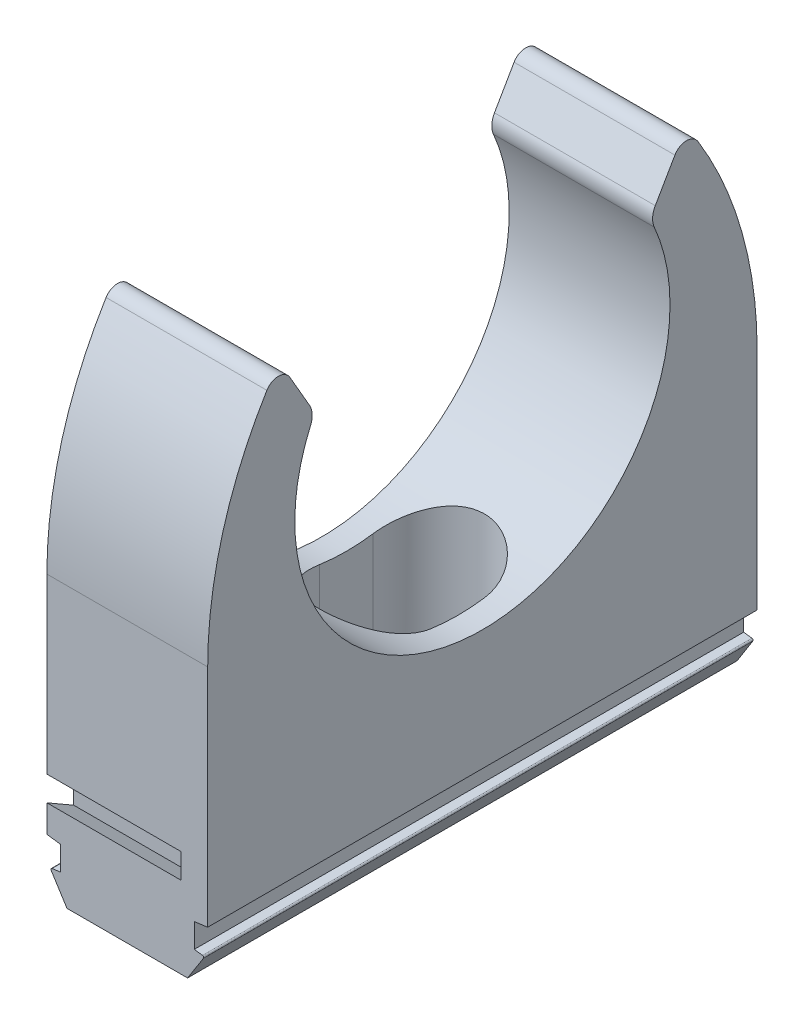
ISO-10303-21;
HEADER;
FILE_DESCRIPTION(('STEP AP214'),'2;1');
FILE_NAME('part.step','',(''),(''),'','','');
FILE_SCHEMA(('AUTOMOTIVE_DESIGN { 1 0 10303 214 1 1 1 1 }'));
ENDSEC;
DATA;
#1=APPLICATION_CONTEXT('core data for automotive mechanical design processes');
#2=APPLICATION_PROTOCOL_DEFINITION('international standard','automotive_design',2000,#1);
#3=PRODUCT_CONTEXT('',#1,'mechanical');
#4=PRODUCT('Part','Part','',(#3));
#5=PRODUCT_RELATED_PRODUCT_CATEGORY('part','',(#4));
#6=PRODUCT_DEFINITION_FORMATION('','',#4);
#7=PRODUCT_DEFINITION_CONTEXT('part definition',#1,'design');
#8=PRODUCT_DEFINITION('design','',#6,#7);
#9=PRODUCT_DEFINITION_SHAPE('','',#8);
#10=(LENGTH_UNIT() NAMED_UNIT(*) SI_UNIT(.MILLI.,.METRE.));
#11=(NAMED_UNIT(*) PLANE_ANGLE_UNIT() SI_UNIT($,.RADIAN.));
#12=(NAMED_UNIT(*) SI_UNIT($,.STERADIAN.) SOLID_ANGLE_UNIT());
#13=UNCERTAINTY_MEASURE_WITH_UNIT(LENGTH_MEASURE(1.E-05),#10,'distance_accuracy_value','');
#14=(GEOMETRIC_REPRESENTATION_CONTEXT(3) GLOBAL_UNCERTAINTY_ASSIGNED_CONTEXT((#13)) GLOBAL_UNIT_ASSIGNED_CONTEXT((#10,
#11,#12)) REPRESENTATION_CONTEXT('',''));
#15=CARTESIAN_POINT('',(0.,0.,0.));
#16=DIRECTION('',(0.,0.,1.));
#17=DIRECTION('',(1.,0.,0.));
#18=AXIS2_PLACEMENT_3D('',#15,#16,#17);
#19=CARTESIAN_POINT('',(-6.,-27.,-20.5));
#20=DIRECTION('',(0.,0.,-1.));
#21=DIRECTION('',(0.,1.,0.));
#22=AXIS2_PLACEMENT_3D('',#19,#20,#21);
#23=PLANE('',#22);
#24=DIRECTION('',(-1.,0.,0.));
#25=VECTOR('',#24,1.);
#26=CARTESIAN_POINT('',(4.,-19.,-20.5));
#27=LINE('',#26,#25);
#28=CARTESIAN_POINT('',(4.,-19.,-20.5));
#29=VERTEX_POINT('',#28);
#30=CARTESIAN_POINT('',(-6.,-19.,-20.5));
#31=VERTEX_POINT('',#30);
#32=EDGE_CURVE('E328',#29,#31,#27,.T.);
#33=ORIENTED_EDGE('',*,*,#32,.T.);
#34=DIRECTION('',(0.,1.,0.));
#35=VECTOR('',#34,1.);
#36=CARTESIAN_POINT('',(-6.,-27.,-20.5));
#37=LINE('',#36,#35);
#38=CARTESIAN_POINT('',(-6.,-6.14468938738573,-20.5));
#39=VERTEX_POINT('',#38);
#40=EDGE_CURVE('E491',#31,#39,#37,.T.);
#41=ORIENTED_EDGE('',*,*,#40,.T.);
#42=DIRECTION('',(1.,0.,0.));
#43=VECTOR('',#42,1.);
#44=CARTESIAN_POINT('',(-6.,-6.14468938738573,-20.5));
#45=LINE('',#44,#43);
#46=CARTESIAN_POINT('',(6.,-6.14468938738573,-20.5));
#47=VERTEX_POINT('',#46);
#48=EDGE_CURVE('E551',#39,#47,#45,.T.);
#49=ORIENTED_EDGE('',*,*,#48,.T.);
#50=DIRECTION('',(0.,1.,0.));
#51=VECTOR('',#50,1.);
#52=CARTESIAN_POINT('',(6.,-27.,-20.5));
#53=LINE('',#52,#51);
#54=CARTESIAN_POINT('',(6.,-22.9683475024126,-20.5));
#55=VERTEX_POINT('',#54);
#56=EDGE_CURVE('E524',#55,#47,#53,.T.);
#57=ORIENTED_EDGE('',*,*,#56,.F.);
#58=DIRECTION('',(-0.991444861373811,-0.130526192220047,0.));
#59=VECTOR('',#58,1.);
#60=CARTESIAN_POINT('',(6.,-22.9683475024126,-20.5));
#61=LINE('',#60,#59);
#62=CARTESIAN_POINT('',(5.,-23.1,-20.5));
#63=VERTEX_POINT('',#62);
#64=EDGE_CURVE('E345',#55,#63,#61,.T.);
#65=ORIENTED_EDGE('',*,*,#64,.T.);
#66=DIRECTION('',(0.,-1.,0.));
#67=VECTOR('',#66,1.);
#68=CARTESIAN_POINT('',(5.,-23.1,-20.5));
#69=LINE('',#68,#67);
#70=CARTESIAN_POINT('',(5.,-24.9,-20.5));
#71=VERTEX_POINT('',#70);
#72=EDGE_CURVE('E342',#63,#71,#69,.T.);
#73=ORIENTED_EDGE('',*,*,#72,.T.);
#74=DIRECTION('',(0.991444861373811,-0.130526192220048,0.));
#75=VECTOR('',#74,1.);
#76=CARTESIAN_POINT('',(5.,-24.9,-20.5));
#77=LINE('',#76,#75);
#78=CARTESIAN_POINT('',(5.61305261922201,-24.9807099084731,-20.5));
#79=VERTEX_POINT('',#78);
#80=EDGE_CURVE('E339',#71,#79,#77,.T.);
#81=ORIENTED_EDGE('',*,*,#80,.T.);
#82=CARTESIAN_POINT('',(5.6,-25.0798543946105,-20.5));
#83=DIRECTION('',(0.,0.,-1.));
#84=DIRECTION('',(0.,1.,0.));
#85=AXIS2_PLACEMENT_3D('',#82,#83,#84);
#86=CIRCLE('',#85,0.100000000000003);
#87=CARTESIAN_POINT('',(5.68443533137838,-25.1334330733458,-20.5));
#88=VERTEX_POINT('',#87);
#89=EDGE_CURVE('E330',#79,#88,#86,.T.);
#90=ORIENTED_EDGE('',*,*,#89,.T.);
#91=DIRECTION('',(-0.535786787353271,-0.844353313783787,0.));
#92=VECTOR('',#91,1.);
#93=CARTESIAN_POINT('',(5.68443533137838,-25.1334330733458,-20.5));
#94=LINE('',#93,#92);
#95=CARTESIAN_POINT('',(4.5,-27.,-20.5));
#96=VERTEX_POINT('',#95);
#97=EDGE_CURVE('E348',#88,#96,#94,.T.);
#98=ORIENTED_EDGE('',*,*,#97,.T.);
#99=DIRECTION('',(1.,0.,0.));
#100=VECTOR('',#99,1.);
#101=CARTESIAN_POINT('',(-6.,-27.,-20.5));
#102=LINE('',#101,#100);
#103=CARTESIAN_POINT('',(-4.5,-27.,-20.5));
#104=VERTEX_POINT('',#103);
#105=EDGE_CURVE('E554',#104,#96,#102,.T.);
#106=ORIENTED_EDGE('',*,*,#105,.F.);
#107=DIRECTION('',(-0.535786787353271,0.844353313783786,0.));
#108=VECTOR('',#107,1.);
#109=CARTESIAN_POINT('',(-5.68443533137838,-25.1334330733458,-20.5));
#110=LINE('',#109,#108);
#111=CARTESIAN_POINT('',(-5.68443533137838,-25.1334330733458,-20.5));
#112=VERTEX_POINT('',#111);
#113=EDGE_CURVE('E378',#104,#112,#110,.T.);
#114=ORIENTED_EDGE('',*,*,#113,.T.);
#115=CARTESIAN_POINT('',(-5.6,-25.0798543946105,-20.5));
#116=DIRECTION('',(0.,0.,-1.));
#117=DIRECTION('',(0.,1.,0.));
#118=AXIS2_PLACEMENT_3D('',#115,#116,#117);
#119=CIRCLE('',#118,0.1);
#120=CARTESIAN_POINT('',(-5.613052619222,-24.9807099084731,-20.5));
#121=VERTEX_POINT('',#120);
#122=EDGE_CURVE('E381',#112,#121,#119,.T.);
#123=ORIENTED_EDGE('',*,*,#122,.T.);
#124=DIRECTION('',(0.99144486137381,0.130526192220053,0.));
#125=VECTOR('',#124,1.);
#126=CARTESIAN_POINT('',(-5.,-24.9,-20.5));
#127=LINE('',#126,#125);
#128=CARTESIAN_POINT('',(-5.,-24.9,-20.5));
#129=VERTEX_POINT('',#128);
#130=EDGE_CURVE('E384',#121,#129,#127,.T.);
#131=ORIENTED_EDGE('',*,*,#130,.T.);
#132=DIRECTION('',(0.,1.,0.));
#133=VECTOR('',#132,1.);
#134=CARTESIAN_POINT('',(-5.,-23.1,-20.5));
#135=LINE('',#134,#133);
#136=CARTESIAN_POINT('',(-5.,-23.1,-20.5));
#137=VERTEX_POINT('',#136);
#138=EDGE_CURVE('E387',#129,#137,#135,.T.);
#139=ORIENTED_EDGE('',*,*,#138,.T.);
#140=DIRECTION('',(-0.99144486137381,0.130526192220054,0.));
#141=VECTOR('',#140,1.);
#142=CARTESIAN_POINT('',(-6.,-22.9683475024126,-20.5));
#143=LINE('',#142,#141);
#144=CARTESIAN_POINT('',(-6.,-22.9683475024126,-20.5));
#145=VERTEX_POINT('',#144);
#146=EDGE_CURVE('E390',#137,#145,#143,.T.);
#147=ORIENTED_EDGE('',*,*,#146,.T.);
#148=CARTESIAN_POINT('',(-6.,-21.,-20.5));
#149=VERTEX_POINT('',#148);
#150=EDGE_CURVE('E492',#145,#149,#37,.T.);
#151=ORIENTED_EDGE('',*,*,#150,.T.);
#152=DIRECTION('',(-1.,0.,0.));
#153=VECTOR('',#152,1.);
#154=CARTESIAN_POINT('',(4.,-21.,-20.5));
#155=LINE('',#154,#153);
#156=CARTESIAN_POINT('',(4.,-21.,-20.5));
#157=VERTEX_POINT('',#156);
#158=EDGE_CURVE('E331',#157,#149,#155,.T.);
#159=ORIENTED_EDGE('',*,*,#158,.F.);
#160=DIRECTION('',(0.,1.,0.));
#161=VECTOR('',#160,1.);
#162=CARTESIAN_POINT('',(4.,-19.,-20.5));
#163=LINE('',#162,#161);
#164=EDGE_CURVE('E57',#157,#29,#163,.T.);
#165=ORIENTED_EDGE('',*,*,#164,.T.);
#166=EDGE_LOOP('',(#33,#41,#49,#57,#65,#73,#81,#90,#98,#106,#114,#123,#131,#139,#147,#151,#159,#165));
#167=FACE_BOUND('',#166,.T.);
#168=ADVANCED_FACE('F34',(#167),#23,.T.);
#169=CARTESIAN_POINT('',(-6.,-27.,-20.5));
#170=DIRECTION('',(0.,-1.,0.));
#171=DIRECTION('',(0.,0.,-1.));
#172=AXIS2_PLACEMENT_3D('',#169,#170,#171);
#173=PLANE('',#172);
#174=CARTESIAN_POINT('',(0.,-27.,-1.25000000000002));
#175=DIRECTION('',(0.,-1.,0.));
#176=DIRECTION('',(0.,0.,1.));
#177=AXIS2_PLACEMENT_3D('',#174,#175,#176);
#178=CIRCLE('',#177,2.5);
#179=CARTESIAN_POINT('',(-2.5,-27.,-1.25000000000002));
#180=VERTEX_POINT('',#179);
#181=CARTESIAN_POINT('',(2.5,-27.,-1.25000000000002));
#182=VERTEX_POINT('',#181);
#183=EDGE_CURVE('E429',#180,#182,#178,.T.);
#184=ORIENTED_EDGE('',*,*,#183,.F.);
#185=DIRECTION('',(0.,0.,-1.));
#186=VECTOR('',#185,1.);
#187=CARTESIAN_POINT('',(-2.5,-27.,-1.25000000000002));
#188=LINE('',#187,#186);
#189=CARTESIAN_POINT('',(-2.5,-27.,1.24999999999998));
#190=VERTEX_POINT('',#189);
#191=EDGE_CURVE('E437',#190,#180,#188,.T.);
#192=ORIENTED_EDGE('',*,*,#191,.F.);
#193=CARTESIAN_POINT('',(0.,-27.,1.24999999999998));
#194=DIRECTION('',(0.,-1.,0.));
#195=DIRECTION('',(0.,0.,1.));
#196=AXIS2_PLACEMENT_3D('',#193,#194,#195);
#197=CIRCLE('',#196,2.5);
#198=CARTESIAN_POINT('',(2.5,-27.,1.24999999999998));
#199=VERTEX_POINT('',#198);
#200=EDGE_CURVE('E434',#199,#190,#197,.T.);
#201=ORIENTED_EDGE('',*,*,#200,.F.);
#202=DIRECTION('',(0.,0.,1.));
#203=VECTOR('',#202,1.);
#204=CARTESIAN_POINT('',(2.5,-27.,1.24999999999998));
#205=LINE('',#204,#203);
#206=EDGE_CURVE('E431',#182,#199,#205,.T.);
#207=ORIENTED_EDGE('',*,*,#206,.F.);
#208=EDGE_LOOP('',(#184,#192,#201,#207));
#209=FACE_BOUND('',#208,.T.);
#210=ORIENTED_EDGE('',*,*,#105,.T.);
#211=DIRECTION('',(0.,0.,-1.));
#212=VECTOR('',#211,1.);
#213=CARTESIAN_POINT('',(4.5,-27.,20.501));
#214=LINE('',#213,#212);
#215=CARTESIAN_POINT('',(4.5,-27.,20.5));
#216=VERTEX_POINT('',#215);
#217=EDGE_CURVE('E371',#216,#96,#214,.T.);
#218=ORIENTED_EDGE('',*,*,#217,.F.);
#219=DIRECTION('',(1.,0.,0.));
#220=VECTOR('',#219,1.);
#221=CARTESIAN_POINT('',(-6.,-27.,20.5));
#222=LINE('',#221,#220);
#223=CARTESIAN_POINT('',(-4.5,-27.,20.5));
#224=VERTEX_POINT('',#223);
#225=EDGE_CURVE('E557',#224,#216,#222,.T.);
#226=ORIENTED_EDGE('',*,*,#225,.F.);
#227=DIRECTION('',(0.,0.,-1.));
#228=VECTOR('',#227,1.);
#229=CARTESIAN_POINT('',(-4.5,-27.,20.501));
#230=LINE('',#229,#228);
#231=EDGE_CURVE('E415',#224,#104,#230,.T.);
#232=ORIENTED_EDGE('',*,*,#231,.T.);
#233=EDGE_LOOP('',(#210,#218,#226,#232));
#234=FACE_BOUND('',#233,.T.);
#235=ADVANCED_FACE('F626',(#209,#234),#173,.T.);
#236=CARTESIAN_POINT('',(-6.,-27.,20.5));
#237=DIRECTION('',(0.,0.,1.));
#238=DIRECTION('',(1.,0.,0.));
#239=AXIS2_PLACEMENT_3D('',#236,#237,#238);
#240=PLANE('',#239);
#241=DIRECTION('',(-1.,0.,0.));
#242=VECTOR('',#241,1.);
#243=CARTESIAN_POINT('',(4.,-20.9267949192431,20.5));
#244=LINE('',#243,#242);
#245=CARTESIAN_POINT('',(4.,-20.9267949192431,20.5));
#246=VERTEX_POINT('',#245);
#247=CARTESIAN_POINT('',(-6.,-20.9267949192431,20.5));
#248=VERTEX_POINT('',#247);
#249=EDGE_CURVE('E323',#246,#248,#244,.T.);
#250=ORIENTED_EDGE('',*,*,#249,.T.);
#251=DIRECTION('',(0.,-1.,0.));
#252=VECTOR('',#251,1.);
#253=CARTESIAN_POINT('',(-6.,-27.,20.5));
#254=LINE('',#253,#252);
#255=CARTESIAN_POINT('',(-6.,-22.9683475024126,20.5));
#256=VERTEX_POINT('',#255);
#257=EDGE_CURVE('E489',#248,#256,#254,.T.);
#258=ORIENTED_EDGE('',*,*,#257,.T.);
#259=DIRECTION('',(-0.99144486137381,0.130526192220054,0.));
#260=VECTOR('',#259,1.);
#261=CARTESIAN_POINT('',(-6.,-22.9683475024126,20.5));
#262=LINE('',#261,#260);
#263=CARTESIAN_POINT('',(-5.,-23.1,20.5));
#264=VERTEX_POINT('',#263);
#265=EDGE_CURVE('E418',#264,#256,#262,.T.);
#266=ORIENTED_EDGE('',*,*,#265,.F.);
#267=DIRECTION('',(0.,1.,0.));
#268=VECTOR('',#267,1.);
#269=CARTESIAN_POINT('',(-5.,-23.1,20.5));
#270=LINE('',#269,#268);
#271=CARTESIAN_POINT('',(-5.,-24.9,20.5));
#272=VERTEX_POINT('',#271);
#273=EDGE_CURVE('E393',#272,#264,#270,.T.);
#274=ORIENTED_EDGE('',*,*,#273,.F.);
#275=DIRECTION('',(0.99144486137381,0.130526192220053,0.));
#276=VECTOR('',#275,1.);
#277=CARTESIAN_POINT('',(-5.,-24.9,20.5));
#278=LINE('',#277,#276);
#279=CARTESIAN_POINT('',(-5.613052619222,-24.9807099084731,20.5));
#280=VERTEX_POINT('',#279);
#281=EDGE_CURVE('E396',#280,#272,#278,.T.);
#282=ORIENTED_EDGE('',*,*,#281,.F.);
#283=CARTESIAN_POINT('',(-5.6,-25.0798543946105,20.5));
#284=DIRECTION('',(0.,0.,1.));
#285=DIRECTION('',(1.,0.,0.));
#286=AXIS2_PLACEMENT_3D('',#283,#284,#285);
#287=CIRCLE('',#286,0.1);
#288=CARTESIAN_POINT('',(-5.68443533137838,-25.1334330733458,20.5));
#289=VERTEX_POINT('',#288);
#290=EDGE_CURVE('E399',#289,#280,#287,.F.);
#291=ORIENTED_EDGE('',*,*,#290,.F.);
#292=DIRECTION('',(-0.535786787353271,0.844353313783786,0.));
#293=VECTOR('',#292,1.);
#294=CARTESIAN_POINT('',(-5.68443533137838,-25.1334330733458,20.5));
#295=LINE('',#294,#293);
#296=EDGE_CURVE('E402',#224,#289,#295,.T.);
#297=ORIENTED_EDGE('',*,*,#296,.F.);
#298=ORIENTED_EDGE('',*,*,#225,.T.);
#299=DIRECTION('',(-0.535786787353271,-0.844353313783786,0.));
#300=VECTOR('',#299,1.);
#301=CARTESIAN_POINT('',(5.68443533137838,-25.1334330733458,20.5));
#302=LINE('',#301,#300);
#303=CARTESIAN_POINT('',(5.68443533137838,-25.1334330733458,20.5));
#304=VERTEX_POINT('',#303);
#305=EDGE_CURVE('E360',#304,#216,#302,.T.);
#306=ORIENTED_EDGE('',*,*,#305,.F.);
#307=CARTESIAN_POINT('',(5.6,-25.0798543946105,20.5));
#308=DIRECTION('',(0.,0.,1.));
#309=DIRECTION('',(1.,0.,0.));
#310=AXIS2_PLACEMENT_3D('',#307,#308,#309);
#311=CIRCLE('',#310,0.100000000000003);
#312=CARTESIAN_POINT('',(5.61305261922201,-24.9807099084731,20.5));
#313=VERTEX_POINT('',#312);
#314=EDGE_CURVE('E357',#313,#304,#311,.F.);
#315=ORIENTED_EDGE('',*,*,#314,.F.);
#316=DIRECTION('',(0.991444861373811,-0.130526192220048,0.));
#317=VECTOR('',#316,1.);
#318=CARTESIAN_POINT('',(5.,-24.9,20.5));
#319=LINE('',#318,#317);
#320=CARTESIAN_POINT('',(5.,-24.9,20.5));
#321=VERTEX_POINT('',#320);
#322=EDGE_CURVE('E375',#321,#313,#319,.T.);
#323=ORIENTED_EDGE('',*,*,#322,.F.);
#324=DIRECTION('',(0.,-1.,0.));
#325=VECTOR('',#324,1.);
#326=CARTESIAN_POINT('',(5.,-23.1,20.5));
#327=LINE('',#326,#325);
#328=CARTESIAN_POINT('',(5.,-23.1,20.5));
#329=VERTEX_POINT('',#328);
#330=EDGE_CURVE('E351',#329,#321,#327,.T.);
#331=ORIENTED_EDGE('',*,*,#330,.F.);
#332=DIRECTION('',(-0.991444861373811,-0.130526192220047,0.));
#333=VECTOR('',#332,1.);
#334=CARTESIAN_POINT('',(6.,-22.9683475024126,20.5));
#335=LINE('',#334,#333);
#336=CARTESIAN_POINT('',(6.,-22.9683475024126,20.5));
#337=VERTEX_POINT('',#336);
#338=EDGE_CURVE('E354',#337,#329,#335,.T.);
#339=ORIENTED_EDGE('',*,*,#338,.F.);
#340=DIRECTION('',(0.,-1.,0.));
#341=VECTOR('',#340,1.);
#342=CARTESIAN_POINT('',(6.,-27.,20.5));
#343=LINE('',#342,#341);
#344=CARTESIAN_POINT('',(6.,-6.14468938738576,20.5));
#345=VERTEX_POINT('',#344);
#346=EDGE_CURVE('E521',#345,#337,#343,.T.);
#347=ORIENTED_EDGE('',*,*,#346,.F.);
#348=DIRECTION('',(1.,0.,0.));
#349=VECTOR('',#348,1.);
#350=CARTESIAN_POINT('',(-6.,-6.14468938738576,20.5));
#351=LINE('',#350,#349);
#352=CARTESIAN_POINT('',(-6.,-6.14468938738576,20.5));
#353=VERTEX_POINT('',#352);
#354=EDGE_CURVE('E560',#353,#345,#351,.T.);
#355=ORIENTED_EDGE('',*,*,#354,.F.);
#356=CARTESIAN_POINT('',(-6.,-19.0732050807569,20.5));
#357=VERTEX_POINT('',#356);
#358=EDGE_CURVE('E300',#353,#357,#254,.T.);
#359=ORIENTED_EDGE('',*,*,#358,.T.);
#360=DIRECTION('',(-1.,0.,0.));
#361=VECTOR('',#360,1.);
#362=CARTESIAN_POINT('',(4.,-19.0732050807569,20.5));
#363=LINE('',#362,#361);
#364=CARTESIAN_POINT('',(4.,-19.0732050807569,20.5));
#365=VERTEX_POINT('',#364);
#366=EDGE_CURVE('E49',#365,#357,#363,.T.);
#367=ORIENTED_EDGE('',*,*,#366,.F.);
#368=DIRECTION('',(0.,1.,0.));
#369=VECTOR('',#368,1.);
#370=CARTESIAN_POINT('',(4.,-19.0732050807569,20.5));
#371=LINE('',#370,#369);
#372=EDGE_CURVE('E286',#246,#365,#371,.T.);
#373=ORIENTED_EDGE('',*,*,#372,.F.);
#374=EDGE_LOOP('',(#250,#258,#266,#274,#282,#291,#297,#298,#306,#315,#323,#331,#339,#347,#355,
#359,#367,#373));
#375=FACE_BOUND('',#374,.T.);
#376=ADVANCED_FACE('F298',(#375),#240,.T.);
#377=CARTESIAN_POINT('',(6.,6.2136945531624,14.2));
#378=DIRECTION('',(-1.,0.,0.));
#379=DIRECTION('',(0.,0.,1.));
#380=AXIS2_PLACEMENT_3D('',#377,#378,#379);
#381=PLANE('',#380);
#382=DIRECTION('',(0.,0.,-1.));
#383=VECTOR('',#382,1.);
#384=CARTESIAN_POINT('',(6.,-22.9683475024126,20.501));
#385=LINE('',#384,#383);
#386=EDGE_CURVE('E368',#337,#55,#385,.T.);
#387=ORIENTED_EDGE('',*,*,#386,.T.);
#388=ORIENTED_EDGE('',*,*,#56,.T.);
#389=CARTESIAN_POINT('',(6.,-6.14468938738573,9.49999999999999));
#390=DIRECTION('',(1.,0.,0.));
#391=DIRECTION('',(0.,0.,-1.));
#392=AXIS2_PLACEMENT_3D('',#389,#390,#391);
#393=CIRCLE('',#392,30.);
#394=CARTESIAN_POINT('',(6.,9.52223066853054,-16.0841282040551));
#395=VERTEX_POINT('',#394);
#396=EDGE_CURVE('E526',#47,#395,#393,.T.);
#397=ORIENTED_EDGE('',*,*,#396,.T.);
#398=CARTESIAN_POINT('',(6.,9.,-15.2313239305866));
#399=DIRECTION('',(1.,0.,0.));
#400=DIRECTION('',(0.,0.,-1.));
#401=AXIS2_PLACEMENT_3D('',#398,#399,#400);
#402=CIRCLE('',#401,1.);
#403=CARTESIAN_POINT('',(6.,9.50000000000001,-14.3652985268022));
#404=VERTEX_POINT('',#403);
#405=EDGE_CURVE('E529',#395,#404,#402,.T.);
#406=ORIENTED_EDGE('',*,*,#405,.T.);
#407=DIRECTION('',(0.,-0.866025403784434,0.500000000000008));
#408=VECTOR('',#407,1.);
#409=CARTESIAN_POINT('',(6.,9.50000000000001,-14.3652985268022));
#410=LINE('',#409,#408);
#411=CARTESIAN_POINT('',(6.,6.96369455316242,-12.9009618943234));
#412=VERTEX_POINT('',#411);
#413=EDGE_CURVE('E532',#404,#412,#410,.T.);
#414=ORIENTED_EDGE('',*,*,#413,.T.);
#415=CARTESIAN_POINT('',(6.,6.21369455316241,-14.2));
#416=DIRECTION('',(1.,0.,0.));
#417=DIRECTION('',(0.,0.,-1.));
#418=AXIS2_PLACEMENT_3D('',#415,#416,#417);
#419=CIRCLE('',#418,1.5);
#420=CARTESIAN_POINT('',(6.,5.61236927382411,-12.8258064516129));
#421=VERTEX_POINT('',#420);
#422=EDGE_CURVE('E535',#412,#421,#419,.T.);
#423=ORIENTED_EDGE('',*,*,#422,.T.);
#424=CARTESIAN_POINT('',(6.,0.,0.));
#425=DIRECTION('',(-1.,0.,0.));
#426=DIRECTION('',(0.,0.,-1.));
#427=AXIS2_PLACEMENT_3D('',#424,#425,#426);
#428=CIRCLE('',#427,14.);
#429=CARTESIAN_POINT('',(6.,5.61236927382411,12.8258064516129));
#430=VERTEX_POINT('',#429);
#431=EDGE_CURVE('E480',#421,#430,#428,.T.);
#432=ORIENTED_EDGE('',*,*,#431,.T.);
#433=CARTESIAN_POINT('',(6.,6.2136945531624,14.2));
#434=DIRECTION('',(1.,0.,0.));
#435=DIRECTION('',(0.,0.,1.));
#436=AXIS2_PLACEMENT_3D('',#433,#434,#435);
#437=CIRCLE('',#436,1.5);
#438=CARTESIAN_POINT('',(6.,6.9636945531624,12.9009618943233));
#439=VERTEX_POINT('',#438);
#440=EDGE_CURVE('E475',#430,#439,#437,.T.);
#441=ORIENTED_EDGE('',*,*,#440,.T.);
#442=DIRECTION('',(0.,0.866025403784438,0.500000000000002));
#443=VECTOR('',#442,1.);
#444=CARTESIAN_POINT('',(6.,9.5,14.3652985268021));
#445=LINE('',#444,#443);
#446=CARTESIAN_POINT('',(6.,9.5,14.3652985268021));
#447=VERTEX_POINT('',#446);
#448=EDGE_CURVE('E512',#439,#447,#445,.T.);
#449=ORIENTED_EDGE('',*,*,#448,.T.);
#450=CARTESIAN_POINT('',(6.,9.,15.2313239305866));
#451=DIRECTION('',(1.,0.,0.));
#452=DIRECTION('',(0.,0.,1.));
#453=AXIS2_PLACEMENT_3D('',#450,#451,#452);
#454=CIRCLE('',#453,1.);
#455=CARTESIAN_POINT('',(6.,9.52223066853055,16.0841282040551));
#456=VERTEX_POINT('',#455);
#457=EDGE_CURVE('E515',#447,#456,#454,.T.);
#458=ORIENTED_EDGE('',*,*,#457,.T.);
#459=CARTESIAN_POINT('',(6.,-6.14468938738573,-9.50000000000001));
#460=DIRECTION('',(1.,0.,0.));
#461=DIRECTION('',(0.,0.,1.));
#462=AXIS2_PLACEMENT_3D('',#459,#460,#461);
#463=CIRCLE('',#462,30.);
#464=EDGE_CURVE('E518',#456,#345,#463,.T.);
#465=ORIENTED_EDGE('',*,*,#464,.T.);
#466=ORIENTED_EDGE('',*,*,#346,.T.);
#467=EDGE_LOOP('',(#387,#388,#397,#406,#414,#423,#432,#441,#449,#458,#465,#466));
#468=FACE_BOUND('',#467,.T.);
#469=ADVANCED_FACE('F639',(#468),#381,.F.);
#470=CARTESIAN_POINT('',(-6.,6.2136945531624,14.2));
#471=DIRECTION('',(-1.,0.,0.));
#472=DIRECTION('',(0.,0.,1.));
#473=AXIS2_PLACEMENT_3D('',#470,#471,#472);
#474=PLANE('',#473);
#475=DIRECTION('',(0.,0.499999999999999,0.866025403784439));
#476=VECTOR('',#475,1.);
#477=CARTESIAN_POINT('',(-6.,-20.9267949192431,20.5));
#478=LINE('',#477,#476);
#479=CARTESIAN_POINT('',(-6.,-22.0814954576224,18.5));
#480=VERTEX_POINT('',#479);
#481=EDGE_CURVE('E295',#480,#248,#478,.T.);
#482=ORIENTED_EDGE('',*,*,#481,.F.);
#483=DIRECTION('',(0.,-1.,0.));
#484=VECTOR('',#483,1.);
#485=CARTESIAN_POINT('',(-6.,-17.9185045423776,18.5));
#486=LINE('',#485,#484);
#487=CARTESIAN_POINT('',(-6.,-17.9185045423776,18.5));
#488=VERTEX_POINT('',#487);
#489=EDGE_CURVE('E703',#488,#480,#486,.T.);
#490=ORIENTED_EDGE('',*,*,#489,.F.);
#491=DIRECTION('',(0.,0.499999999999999,-0.866025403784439));
#492=VECTOR('',#491,1.);
#493=CARTESIAN_POINT('',(-6.,-19.0732050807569,20.5));
#494=LINE('',#493,#492);
#495=EDGE_CURVE('E706',#357,#488,#494,.T.);
#496=ORIENTED_EDGE('',*,*,#495,.F.);
#497=ORIENTED_EDGE('',*,*,#358,.F.);
#498=CARTESIAN_POINT('',(-6.,-6.14468938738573,-9.50000000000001));
#499=DIRECTION('',(1.,0.,0.));
#500=DIRECTION('',(0.,0.,1.));
#501=AXIS2_PLACEMENT_3D('',#498,#499,#500);
#502=CIRCLE('',#501,30.);
#503=CARTESIAN_POINT('',(-6.,9.52223066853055,16.0841282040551));
#504=VERTEX_POINT('',#503);
#505=EDGE_CURVE('E486',#504,#353,#502,.T.);
#506=ORIENTED_EDGE('',*,*,#505,.F.);
#507=CARTESIAN_POINT('',(-6.,9.,15.2313239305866));
#508=DIRECTION('',(1.,0.,0.));
#509=DIRECTION('',(0.,0.,1.));
#510=AXIS2_PLACEMENT_3D('',#507,#508,#509);
#511=CIRCLE('',#510,1.);
#512=CARTESIAN_POINT('',(-6.,9.5,14.3652985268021));
#513=VERTEX_POINT('',#512);
#514=EDGE_CURVE('E483',#513,#504,#511,.T.);
#515=ORIENTED_EDGE('',*,*,#514,.F.);
#516=DIRECTION('',(0.,0.866025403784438,0.500000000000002));
#517=VECTOR('',#516,1.);
#518=CARTESIAN_POINT('',(-6.,9.5,14.3652985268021));
#519=LINE('',#518,#517);
#520=CARTESIAN_POINT('',(-6.,6.9636945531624,12.9009618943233));
#521=VERTEX_POINT('',#520);
#522=EDGE_CURVE('E479',#521,#513,#519,.T.);
#523=ORIENTED_EDGE('',*,*,#522,.F.);
#524=CARTESIAN_POINT('',(-6.,6.2136945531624,14.2));
#525=DIRECTION('',(1.,0.,0.));
#526=DIRECTION('',(0.,0.,1.));
#527=AXIS2_PLACEMENT_3D('',#524,#525,#526);
#528=CIRCLE('',#527,1.5);
#529=CARTESIAN_POINT('',(-6.,5.61236927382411,12.8258064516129));
#530=VERTEX_POINT('',#529);
#531=EDGE_CURVE('E476',#530,#521,#528,.T.);
#532=ORIENTED_EDGE('',*,*,#531,.F.);
#533=CARTESIAN_POINT('',(-6.,0.,0.));
#534=DIRECTION('',(-1.,0.,0.));
#535=DIRECTION('',(0.,0.,-1.));
#536=AXIS2_PLACEMENT_3D('',#533,#534,#535);
#537=CIRCLE('',#536,14.);
#538=CARTESIAN_POINT('',(-6.,5.61236927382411,-12.8258064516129));
#539=VERTEX_POINT('',#538);
#540=EDGE_CURVE('E506',#539,#530,#537,.T.);
#541=ORIENTED_EDGE('',*,*,#540,.F.);
#542=CARTESIAN_POINT('',(-6.,6.21369455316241,-14.2));
#543=DIRECTION('',(1.,0.,0.));
#544=DIRECTION('',(0.,0.,-1.));
#545=AXIS2_PLACEMENT_3D('',#542,#543,#544);
#546=CIRCLE('',#545,1.5);
#547=CARTESIAN_POINT('',(-6.,6.96369455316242,-12.9009618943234));
#548=VERTEX_POINT('',#547);
#549=EDGE_CURVE('E503',#548,#539,#546,.T.);
#550=ORIENTED_EDGE('',*,*,#549,.F.);
#551=DIRECTION('',(0.,-0.866025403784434,0.500000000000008));
#552=VECTOR('',#551,1.);
#553=CARTESIAN_POINT('',(-6.,9.50000000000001,-14.3652985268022));
#554=LINE('',#553,#552);
#555=CARTESIAN_POINT('',(-6.,9.50000000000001,-14.3652985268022));
#556=VERTEX_POINT('',#555);
#557=EDGE_CURVE('E500',#556,#548,#554,.T.);
#558=ORIENTED_EDGE('',*,*,#557,.F.);
#559=CARTESIAN_POINT('',(-6.,9.,-15.2313239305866));
#560=DIRECTION('',(1.,0.,0.));
#561=DIRECTION('',(0.,0.,-1.));
#562=AXIS2_PLACEMENT_3D('',#559,#560,#561);
#563=CIRCLE('',#562,1.);
#564=CARTESIAN_POINT('',(-6.,9.52223066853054,-16.0841282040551));
#565=VERTEX_POINT('',#564);
#566=EDGE_CURVE('E497',#565,#556,#563,.T.);
#567=ORIENTED_EDGE('',*,*,#566,.F.);
#568=CARTESIAN_POINT('',(-6.,-6.14468938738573,9.49999999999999));
#569=DIRECTION('',(1.,0.,0.));
#570=DIRECTION('',(0.,0.,-1.));
#571=AXIS2_PLACEMENT_3D('',#568,#569,#570);
#572=CIRCLE('',#571,30.);
#573=EDGE_CURVE('E494',#39,#565,#572,.T.);
#574=ORIENTED_EDGE('',*,*,#573,.F.);
#575=ORIENTED_EDGE('',*,*,#40,.F.);
#576=DIRECTION('',(0.,0.500000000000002,-0.866025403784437));
#577=VECTOR('',#576,1.);
#578=CARTESIAN_POINT('',(-6.,-19.,-20.5));
#579=LINE('',#578,#577);
#580=CARTESIAN_POINT('',(-6.,-17.8452994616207,-22.5));
#581=VERTEX_POINT('',#580);
#582=EDGE_CURVE('E319',#31,#581,#579,.T.);
#583=ORIENTED_EDGE('',*,*,#582,.T.);
#584=DIRECTION('',(0.,-1.,0.));
#585=VECTOR('',#584,1.);
#586=CARTESIAN_POINT('',(-6.,-17.8452994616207,-22.5));
#587=LINE('',#586,#585);
#588=CARTESIAN_POINT('',(-6.,-22.1547005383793,-22.5));
#589=VERTEX_POINT('',#588);
#590=EDGE_CURVE('E322',#581,#589,#587,.T.);
#591=ORIENTED_EDGE('',*,*,#590,.T.);
#592=DIRECTION('',(0.,0.500000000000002,0.866025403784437));
#593=VECTOR('',#592,1.);
#594=CARTESIAN_POINT('',(-6.,-21.,-20.5));
#595=LINE('',#594,#593);
#596=EDGE_CURVE('E311',#589,#149,#595,.T.);
#597=ORIENTED_EDGE('',*,*,#596,.T.);
#598=ORIENTED_EDGE('',*,*,#150,.F.);
#599=DIRECTION('',(0.,0.,-1.));
#600=VECTOR('',#599,1.);
#601=CARTESIAN_POINT('',(-6.,-22.9683475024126,20.501));
#602=LINE('',#601,#600);
#603=EDGE_CURVE('E405',#256,#145,#602,.T.);
#604=ORIENTED_EDGE('',*,*,#603,.F.);
#605=ORIENTED_EDGE('',*,*,#257,.F.);
#606=EDGE_LOOP('',(#482,#490,#496,#497,#506,#515,#523,#532,#541,#550,#558,#567,#574,#575,#583,
#591,#597,#598,#604,#605));
#607=FACE_BOUND('',#606,.T.);
#608=ADVANCED_FACE('F658',(#607),#474,.T.);
#609=CARTESIAN_POINT('',(-6.,6.2136945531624,14.2));
#610=DIRECTION('',(1.,0.,0.));
#611=DIRECTION('',(0.,0.,-1.));
#612=AXIS2_PLACEMENT_3D('',#609,#610,#611);
#613=CYLINDRICAL_SURFACE('',#612,1.5);
#614=ORIENTED_EDGE('',*,*,#440,.F.);
#615=DIRECTION('',(1.,0.,0.));
#616=VECTOR('',#615,1.);
#617=CARTESIAN_POINT('',(-6.,5.61236927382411,12.8258064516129));
#618=LINE('',#617,#616);
#619=EDGE_CURVE('E540',#530,#430,#618,.T.);
#620=ORIENTED_EDGE('',*,*,#619,.F.);
#621=ORIENTED_EDGE('',*,*,#531,.T.);
#622=DIRECTION('',(1.,0.,0.));
#623=VECTOR('',#622,1.);
#624=CARTESIAN_POINT('',(-6.,6.9636945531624,12.9009618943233));
#625=LINE('',#624,#623);
#626=EDGE_CURVE('E509',#521,#439,#625,.T.);
#627=ORIENTED_EDGE('',*,*,#626,.T.);
#628=EDGE_LOOP('',(#614,#620,#621,#627));
#629=FACE_BOUND('',#628,.T.);
#630=ADVANCED_FACE('F36',(#629),#613,.T.);
#631=CARTESIAN_POINT('',(-6.,0.,0.));
#632=DIRECTION('',(1.,0.,0.));
#633=DIRECTION('',(0.,0.,-1.));
#634=AXIS2_PLACEMENT_3D('',#631,#632,#633);
#635=CYLINDRICAL_SURFACE('',#634,14.);
#636=CARTESIAN_POINT('',(-4.15,0.,0.));
#637=DIRECTION('',(-1.,0.,0.));
#638=DIRECTION('',(0.,0.,1.));
#639=AXIS2_PLACEMENT_3D('',#636,#637,#638);
#640=CIRCLE('',#639,14.);
#641=CARTESIAN_POINT('',(-4.15,-13.856406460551,-2.));
#642=VERTEX_POINT('',#641);
#643=CARTESIAN_POINT('',(-4.15,-13.856406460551,2.));
#644=VERTEX_POINT('',#643);
#645=EDGE_CURVE('E13',#642,#644,#640,.T.);
#646=ORIENTED_EDGE('',*,*,#645,.F.);
#647=CARTESIAN_POINT('',(4.15,-13.856406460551,-2.));
#648=CARTESIAN_POINT('',(4.15001305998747,-13.8394108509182,-2.1178501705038));
#649=CARTESIAN_POINT('',(4.14498050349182,-13.820886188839,-2.23546104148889));
#650=CARTESIAN_POINT('',(4.1250428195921,-13.7810168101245,-2.46931854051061));
#651=CARTESIAN_POINT('',(4.11014128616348,-13.7596731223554,-2.58556564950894));
#652=CARTESIAN_POINT('',(4.07074038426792,-13.7144557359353,-2.81556788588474));
#653=CARTESIAN_POINT('',(4.04626856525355,-13.6905894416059,-2.92932918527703));
#654=CARTESIAN_POINT('',(3.98803830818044,-13.6406037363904,-3.15391661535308));
#655=CARTESIAN_POINT('',(3.95427921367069,-13.614484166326,-3.26474253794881));
#656=CARTESIAN_POINT('',(3.8396287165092,-13.5333360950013,-3.5915098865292));
#657=CARTESIAN_POINT('',(3.74528610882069,-13.4754287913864,-3.80218795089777));
#658=CARTESIAN_POINT('',(3.52374264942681,-13.3554787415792,-4.20420956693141));
#659=CARTESIAN_POINT('',(3.39651733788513,-13.2934329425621,-4.39553857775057));
#660=CARTESIAN_POINT('',(3.10645768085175,-13.1666769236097,-4.76211648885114));
#661=CARTESIAN_POINT('',(2.94236729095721,-13.1019627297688,-4.93637188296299));
#662=CARTESIAN_POINT('',(2.58546987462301,-12.977455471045,-5.25499438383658));
#663=CARTESIAN_POINT('',(2.39265926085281,-12.9176630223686,-5.39935775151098));
#664=CARTESIAN_POINT('',(2.08545234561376,-12.8357659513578,-5.58998389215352));
#665=CARTESIAN_POINT('',(1.97995919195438,-12.8097476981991,-5.64924342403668));
#666=CARTESIAN_POINT('',(1.76360878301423,-12.7609737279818,-5.75856994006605));
#667=CARTESIAN_POINT('',(1.65275397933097,-12.7382165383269,-5.80864107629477));
#668=CARTESIAN_POINT('',(1.42649211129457,-12.6966092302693,-5.89903324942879));
#669=CARTESIAN_POINT('',(1.31108715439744,-12.6777573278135,-5.93935873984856));
#670=CARTESIAN_POINT('',(1.07657422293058,-12.6445190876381,-6.00979675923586));
#671=CARTESIAN_POINT('',(0.957466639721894,-12.6301322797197,-6.03991036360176));
#672=CARTESIAN_POINT('',(0.726668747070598,-12.6072888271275,-6.0874381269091));
#673=CARTESIAN_POINT('',(0.615192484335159,-12.5984364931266,-6.10570453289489));
#674=CARTESIAN_POINT('',(0.390865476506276,-12.5851244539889,-6.13309679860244));
#675=CARTESIAN_POINT('',(0.27801484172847,-12.5806643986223,-6.14222338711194));
#676=CARTESIAN_POINT('',(0.0518945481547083,-12.5762693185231,-6.15121738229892));
#677=CARTESIAN_POINT('',(-0.0613749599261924,-12.5763327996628,-6.15108784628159));
#678=CARTESIAN_POINT('',(-0.287427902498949,-12.58097870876,-6.14157979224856));
#679=CARTESIAN_POINT('',(-0.400211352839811,-12.5855609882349,-6.13220157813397));
#680=CARTESIAN_POINT('',(-0.616633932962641,-12.5986417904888,-6.10527903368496));
#681=CARTESIAN_POINT('',(-0.72036681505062,-12.606848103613,-6.08834317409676));
#682=CARTESIAN_POINT('',(-0.925931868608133,-12.6268510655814,-6.04674752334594));
#683=CARTESIAN_POINT('',(-1.02776337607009,-12.6386489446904,-6.02208508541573));
#684=CARTESIAN_POINT('',(-1.32935449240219,-12.6790264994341,-5.9368598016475));
#685=CARTESIAN_POINT('',(-1.52539249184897,-12.7126017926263,-5.86503593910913));
#686=CARTESIAN_POINT('',(-1.90943460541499,-12.7915267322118,-5.69089043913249));
#687=CARTESIAN_POINT('',(-2.09690263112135,-12.8372536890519,-5.58757222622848));
#688=CARTESIAN_POINT('',(-2.45248931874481,-12.9361823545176,-5.35454797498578));
#689=CARTESIAN_POINT('',(-2.62060091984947,-12.9893867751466,-5.22483235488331));
#690=CARTESIAN_POINT('',(-2.94896199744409,-13.1046494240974,-4.92905688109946));
#691=CARTESIAN_POINT('',(-3.10705773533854,-13.1670716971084,-4.76074885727));
#692=CARTESIAN_POINT('',(-3.39337678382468,-13.2919317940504,-4.40009903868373));
#693=CARTESIAN_POINT('',(-3.52158175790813,-13.354369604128,-4.20774260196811));
#694=CARTESIAN_POINT('',(-3.69161441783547,-13.4463380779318,-3.89978254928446));
#695=CARTESIAN_POINT('',(-3.74553690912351,-13.4774060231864,-3.791146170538));
#696=CARTESIAN_POINT('',(-3.84380499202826,-13.5378745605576,-3.56919451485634));
#697=CARTESIAN_POINT('',(-3.88815427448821,-13.5672757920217,-3.45588106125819));
#698=CARTESIAN_POINT('',(-3.96680668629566,-13.6238934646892,-3.22545970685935));
#699=CARTESIAN_POINT('',(-4.00112212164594,-13.6511125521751,-3.10835665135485));
#700=CARTESIAN_POINT('',(-4.05938523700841,-13.7029763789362,-2.8710930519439));
#701=CARTESIAN_POINT('',(-4.08333799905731,-13.7276223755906,-2.75093403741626));
#702=CARTESIAN_POINT('',(-4.11788715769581,-13.7706630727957,-2.52586581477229));
#703=CARTESIAN_POINT('',(-4.1299087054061,-13.7894470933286,-2.42124782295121));
#704=CARTESIAN_POINT('',(-4.14596422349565,-13.8246958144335,-2.21115018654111));
#705=CARTESIAN_POINT('',(-4.15000819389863,-13.8411633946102,-2.1056717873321));
#706=CARTESIAN_POINT('',(-4.15,-13.856406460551,-2.));
#707=B_SPLINE_CURVE_WITH_KNOTS('',3,(#647,#648,#649,#650,#651,#652,#653,#654,#655,#656,#657,
#658,#659,#660,#661,#662,#663,#664,#665,#666,#667,#668,#669,#670,#671,#672,#673,#674,#675,#676,
#677,#678,#679,#680,#681,#682,#683,#684,#685,#686,#687,#688,#689,#690,#691,#692,#693,#694,#695,
#696,#697,#698,#699,#700,#701,#702,#703,#704,#705,#706),.UNSPECIFIED.,.F.,.F.,(4,2,2,2,2,2,2,2,
2,2,2,2,2,2,2,2,2,2,2,2,2,2,2,2,2,2,2,2,2,4),(0.,0.357062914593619,0.71399586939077,
1.06990881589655,1.42584692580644,2.1363526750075,2.8473884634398,3.58785799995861,
4.32842010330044,4.69929980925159,5.07001150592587,5.44055347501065,5.81105641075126,
6.15053518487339,6.48998688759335,6.82932646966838,7.1686549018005,7.48455679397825,
7.80056701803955,8.43204322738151,9.08604680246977,9.74028819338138,10.4548466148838,
11.169842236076,11.5450503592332,11.9201135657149,12.2947148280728,12.6691321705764,
12.9897192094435,13.3099041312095),.UNSPECIFIED.);
#708=CARTESIAN_POINT('',(4.15,-13.856406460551,-2.));
#709=VERTEX_POINT('',#708);
#710=EDGE_CURVE('E542',#709,#642,#707,.T.);
#711=ORIENTED_EDGE('',*,*,#710,.F.);
#712=CARTESIAN_POINT('',(4.15,0.,0.));
#713=DIRECTION('',(1.,0.,0.));
#714=DIRECTION('',(0.,0.,-1.));
#715=AXIS2_PLACEMENT_3D('',#712,#713,#714);
#716=CIRCLE('',#715,14.);
#717=CARTESIAN_POINT('',(4.15,-13.856406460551,2.));
#718=VERTEX_POINT('',#717);
#719=EDGE_CURVE('E573',#718,#709,#716,.T.);
#720=ORIENTED_EDGE('',*,*,#719,.F.);
#721=CARTESIAN_POINT('',(-4.15,-13.856406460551,2.));
#722=CARTESIAN_POINT('',(-4.15001305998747,-13.8394108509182,2.11785017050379));
#723=CARTESIAN_POINT('',(-4.14498050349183,-13.820886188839,2.23546104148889));
#724=CARTESIAN_POINT('',(-4.1250428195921,-13.7810168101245,2.46931854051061));
#725=CARTESIAN_POINT('',(-4.11014128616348,-13.7596731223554,2.58556564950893));
#726=CARTESIAN_POINT('',(-4.07074038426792,-13.7144557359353,2.81556788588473));
#727=CARTESIAN_POINT('',(-4.04626856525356,-13.6905894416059,2.92932918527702));
#728=CARTESIAN_POINT('',(-3.98803830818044,-13.6406037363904,3.15391661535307));
#729=CARTESIAN_POINT('',(-3.95427921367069,-13.614484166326,3.2647425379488));
#730=CARTESIAN_POINT('',(-3.8396287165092,-13.5333360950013,3.59150988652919));
#731=CARTESIAN_POINT('',(-3.74528610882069,-13.4754287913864,3.80218795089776));
#732=CARTESIAN_POINT('',(-3.52374264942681,-13.3554787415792,4.20420956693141));
#733=CARTESIAN_POINT('',(-3.39651733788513,-13.2934329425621,4.39553857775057));
#734=CARTESIAN_POINT('',(-3.10645768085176,-13.1666769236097,4.76211648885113));
#735=CARTESIAN_POINT('',(-2.94236729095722,-13.1019627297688,4.93637188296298));
#736=CARTESIAN_POINT('',(-2.58546987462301,-12.977455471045,5.25499438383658));
#737=CARTESIAN_POINT('',(-2.39265926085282,-12.9176630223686,5.39935775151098));
#738=CARTESIAN_POINT('',(-2.08545234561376,-12.8357659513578,5.58998389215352));
#739=CARTESIAN_POINT('',(-1.97995919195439,-12.8097476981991,5.64924342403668));
#740=CARTESIAN_POINT('',(-1.76360878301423,-12.7609737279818,5.75856994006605));
#741=CARTESIAN_POINT('',(-1.65275397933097,-12.7382165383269,5.80864107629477));
#742=CARTESIAN_POINT('',(-1.42649211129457,-12.6966092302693,5.89903324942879));
#743=CARTESIAN_POINT('',(-1.31108715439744,-12.6777573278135,5.93935873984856));
#744=CARTESIAN_POINT('',(-1.07657422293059,-12.6445190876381,6.00979675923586));
#745=CARTESIAN_POINT('',(-0.957466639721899,-12.6301322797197,6.03991036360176));
#746=CARTESIAN_POINT('',(-0.726668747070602,-12.6072888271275,6.0874381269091));
#747=CARTESIAN_POINT('',(-0.615192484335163,-12.5984364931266,6.10570453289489));
#748=CARTESIAN_POINT('',(-0.39086547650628,-12.5851244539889,6.13309679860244));
#749=CARTESIAN_POINT('',(-0.278014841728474,-12.5806643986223,6.14222338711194));
#750=CARTESIAN_POINT('',(-0.0518945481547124,-12.5762693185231,6.15121738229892));
#751=CARTESIAN_POINT('',(0.0613749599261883,-12.5763327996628,6.15108784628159));
#752=CARTESIAN_POINT('',(0.287427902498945,-12.58097870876,6.14157979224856));
#753=CARTESIAN_POINT('',(0.400211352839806,-12.5855609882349,6.13220157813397));
#754=CARTESIAN_POINT('',(0.616633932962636,-12.5986417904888,6.10527903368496));
#755=CARTESIAN_POINT('',(0.720366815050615,-12.606848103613,6.08834317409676));
#756=CARTESIAN_POINT('',(0.925931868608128,-12.6268510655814,6.04674752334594));
#757=CARTESIAN_POINT('',(1.02776337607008,-12.6386489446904,6.02208508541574));
#758=CARTESIAN_POINT('',(1.32935449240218,-12.6790264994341,5.9368598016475));
#759=CARTESIAN_POINT('',(1.52539249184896,-12.7126017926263,5.86503593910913));
#760=CARTESIAN_POINT('',(1.90943460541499,-12.7915267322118,5.69089043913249));
#761=CARTESIAN_POINT('',(2.09690263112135,-12.8372536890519,5.58757222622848));
#762=CARTESIAN_POINT('',(2.45248931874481,-12.9361823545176,5.35454797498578));
#763=CARTESIAN_POINT('',(2.62060091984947,-12.9893867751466,5.22483235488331));
#764=CARTESIAN_POINT('',(2.94896199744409,-13.1046494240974,4.92905688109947));
#765=CARTESIAN_POINT('',(3.10705773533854,-13.1670716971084,4.76074885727));
#766=CARTESIAN_POINT('',(3.39337678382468,-13.2919317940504,4.40009903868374));
#767=CARTESIAN_POINT('',(3.52158175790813,-13.354369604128,4.20774260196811));
#768=CARTESIAN_POINT('',(3.69161441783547,-13.4463380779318,3.89978254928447));
#769=CARTESIAN_POINT('',(3.7455369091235,-13.4774060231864,3.79114617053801));
#770=CARTESIAN_POINT('',(3.84380499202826,-13.5378745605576,3.56919451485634));
#771=CARTESIAN_POINT('',(3.8881542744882,-13.5672757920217,3.4558810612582));
#772=CARTESIAN_POINT('',(3.96680668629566,-13.6238934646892,3.22545970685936));
#773=CARTESIAN_POINT('',(4.00112212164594,-13.6511125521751,3.10835665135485));
#774=CARTESIAN_POINT('',(4.05938523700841,-13.7029763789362,2.8710930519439));
#775=CARTESIAN_POINT('',(4.08333799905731,-13.7276223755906,2.75093403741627));
#776=CARTESIAN_POINT('',(4.11788715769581,-13.7706630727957,2.5258658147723));
#777=CARTESIAN_POINT('',(4.1299087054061,-13.7894470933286,2.42124782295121));
#778=CARTESIAN_POINT('',(4.14596422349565,-13.8246958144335,2.2111501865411));
#779=CARTESIAN_POINT('',(4.15000819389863,-13.8411633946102,2.1056717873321));
#780=CARTESIAN_POINT('',(4.15,-13.856406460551,2.));
#781=B_SPLINE_CURVE_WITH_KNOTS('',3,(#721,#722,#723,#724,#725,#726,#727,#728,#729,#730,#731,
#732,#733,#734,#735,#736,#737,#738,#739,#740,#741,#742,#743,#744,#745,#746,#747,#748,#749,#750,
#751,#752,#753,#754,#755,#756,#757,#758,#759,#760,#761,#762,#763,#764,#765,#766,#767,#768,#769,
#770,#771,#772,#773,#774,#775,#776,#777,#778,#779,#780),.UNSPECIFIED.,.F.,.F.,(4,2,2,2,2,2,2,2,
2,2,2,2,2,2,2,2,2,2,2,2,2,2,2,2,2,2,2,2,2,4),(0.,0.357062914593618,0.713995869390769,
1.06990881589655,1.42584692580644,2.1363526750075,2.8473884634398,3.58785799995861,
4.32842010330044,4.6992998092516,5.07001150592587,5.44055347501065,5.81105641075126,
6.15053518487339,6.48998688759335,6.82932646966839,7.1686549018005,7.48455679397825,
7.80056701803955,8.43204322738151,9.08604680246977,9.74028819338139,10.4548466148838,
11.169842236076,11.5450503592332,11.9201135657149,12.2947148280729,12.6691321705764,
12.9897192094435,13.3099041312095),.UNSPECIFIED.);
#782=EDGE_CURVE('E42',#644,#718,#781,.T.);
#783=ORIENTED_EDGE('',*,*,#782,.F.);
#784=EDGE_LOOP('',(#646,#711,#720,#783));
#785=FACE_BOUND('',#784,.T.);
#786=ORIENTED_EDGE('',*,*,#431,.F.);
#787=DIRECTION('',(1.,0.,0.));
#788=VECTOR('',#787,1.);
#789=CARTESIAN_POINT('',(-6.,5.61236927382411,-12.8258064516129));
#790=LINE('',#789,#788);
#791=EDGE_CURVE('E543',#539,#421,#790,.T.);
#792=ORIENTED_EDGE('',*,*,#791,.F.);
#793=ORIENTED_EDGE('',*,*,#540,.T.);
#794=ORIENTED_EDGE('',*,*,#619,.T.);
#795=EDGE_LOOP('',(#786,#792,#793,#794));
#796=FACE_BOUND('',#795,.T.);
#797=ADVANCED_FACE('F574',(#785,#796),#635,.F.);
#798=CARTESIAN_POINT('',(-6.,6.21369455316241,-14.2));
#799=DIRECTION('',(1.,0.,0.));
#800=DIRECTION('',(0.,0.,-1.));
#801=AXIS2_PLACEMENT_3D('',#798,#799,#800);
#802=CYLINDRICAL_SURFACE('',#801,1.5);
#803=ORIENTED_EDGE('',*,*,#422,.F.);
#804=DIRECTION('',(1.,0.,0.));
#805=VECTOR('',#804,1.);
#806=CARTESIAN_POINT('',(-6.,6.96369455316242,-12.9009618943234));
#807=LINE('',#806,#805);
#808=EDGE_CURVE('E545',#548,#412,#807,.T.);
#809=ORIENTED_EDGE('',*,*,#808,.F.);
#810=ORIENTED_EDGE('',*,*,#549,.T.);
#811=ORIENTED_EDGE('',*,*,#791,.T.);
#812=EDGE_LOOP('',(#803,#809,#810,#811));
#813=FACE_BOUND('',#812,.T.);
#814=ADVANCED_FACE('F980',(#813),#802,.T.);
#815=CARTESIAN_POINT('',(-6.,9.50000000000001,-14.3652985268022));
#816=DIRECTION('',(0.,0.500000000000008,0.866025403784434));
#817=DIRECTION('',(0.,-0.866025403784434,0.500000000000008));
#818=AXIS2_PLACEMENT_3D('',#815,#816,#817);
#819=PLANE('',#818);
#820=ORIENTED_EDGE('',*,*,#413,.F.);
#821=DIRECTION('',(1.,0.,0.));
#822=VECTOR('',#821,1.);
#823=CARTESIAN_POINT('',(-6.,9.50000000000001,-14.3652985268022));
#824=LINE('',#823,#822);
#825=EDGE_CURVE('E547',#556,#404,#824,.T.);
#826=ORIENTED_EDGE('',*,*,#825,.F.);
#827=ORIENTED_EDGE('',*,*,#557,.T.);
#828=ORIENTED_EDGE('',*,*,#808,.T.);
#829=EDGE_LOOP('',(#820,#826,#827,#828));
#830=FACE_BOUND('',#829,.T.);
#831=ADVANCED_FACE('F669',(#830),#819,.T.);
#832=CARTESIAN_POINT('',(-6.,9.,-15.2313239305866));
#833=DIRECTION('',(1.,0.,0.));
#834=DIRECTION('',(0.,0.,-1.));
#835=AXIS2_PLACEMENT_3D('',#832,#833,#834);
#836=CYLINDRICAL_SURFACE('',#835,1.);
#837=ORIENTED_EDGE('',*,*,#405,.F.);
#838=DIRECTION('',(1.,0.,0.));
#839=VECTOR('',#838,1.);
#840=CARTESIAN_POINT('',(-6.,9.52223066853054,-16.0841282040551));
#841=LINE('',#840,#839);
#842=EDGE_CURVE('E549',#565,#395,#841,.T.);
#843=ORIENTED_EDGE('',*,*,#842,.F.);
#844=ORIENTED_EDGE('',*,*,#566,.T.);
#845=ORIENTED_EDGE('',*,*,#825,.T.);
#846=EDGE_LOOP('',(#837,#843,#844,#845));
#847=FACE_BOUND('',#846,.T.);
#848=ADVANCED_FACE('F673',(#847),#836,.T.);
#849=CARTESIAN_POINT('',(-6.,-6.14468938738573,9.49999999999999));
#850=DIRECTION('',(1.,0.,0.));
#851=DIRECTION('',(0.,0.,-1.));
#852=AXIS2_PLACEMENT_3D('',#849,#850,#851);
#853=CYLINDRICAL_SURFACE('',#852,30.);
#854=ORIENTED_EDGE('',*,*,#396,.F.);
#855=ORIENTED_EDGE('',*,*,#48,.F.);
#856=ORIENTED_EDGE('',*,*,#573,.T.);
#857=ORIENTED_EDGE('',*,*,#842,.T.);
#858=EDGE_LOOP('',(#854,#855,#856,#857));
#859=FACE_BOUND('',#858,.T.);
#860=ADVANCED_FACE('F634',(#859),#853,.T.);
#861=CARTESIAN_POINT('',(-6.,-6.14468938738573,-9.50000000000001));
#862=DIRECTION('',(1.,0.,0.));
#863=DIRECTION('',(0.,0.,-1.));
#864=AXIS2_PLACEMENT_3D('',#861,#862,#863);
#865=CYLINDRICAL_SURFACE('',#864,30.);
#866=ORIENTED_EDGE('',*,*,#464,.F.);
#867=DIRECTION('',(1.,0.,0.));
#868=VECTOR('',#867,1.);
#869=CARTESIAN_POINT('',(-6.,9.52223066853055,16.0841282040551));
#870=LINE('',#869,#868);
#871=EDGE_CURVE('E562',#504,#456,#870,.T.);
#872=ORIENTED_EDGE('',*,*,#871,.F.);
#873=ORIENTED_EDGE('',*,*,#505,.T.);
#874=ORIENTED_EDGE('',*,*,#354,.T.);
#875=EDGE_LOOP('',(#866,#872,#873,#874));
#876=FACE_BOUND('',#875,.T.);
#877=ADVANCED_FACE('F640',(#876),#865,.T.);
#878=CARTESIAN_POINT('',(-6.,9.,15.2313239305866));
#879=DIRECTION('',(1.,0.,0.));
#880=DIRECTION('',(0.,0.,-1.));
#881=AXIS2_PLACEMENT_3D('',#878,#879,#880);
#882=CYLINDRICAL_SURFACE('',#881,1.);
#883=ORIENTED_EDGE('',*,*,#457,.F.);
#884=DIRECTION('',(1.,0.,0.));
#885=VECTOR('',#884,1.);
#886=CARTESIAN_POINT('',(-6.,9.5,14.3652985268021));
#887=LINE('',#886,#885);
#888=EDGE_CURVE('E564',#513,#447,#887,.T.);
#889=ORIENTED_EDGE('',*,*,#888,.F.);
#890=ORIENTED_EDGE('',*,*,#514,.T.);
#891=ORIENTED_EDGE('',*,*,#871,.T.);
#892=EDGE_LOOP('',(#883,#889,#890,#891));
#893=FACE_BOUND('',#892,.T.);
#894=ADVANCED_FACE('F621',(#893),#882,.T.);
#895=CARTESIAN_POINT('',(-6.,9.5,14.3652985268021));
#896=DIRECTION('',(0.,0.500000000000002,-0.866025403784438));
#897=DIRECTION('',(0.,0.866025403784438,0.500000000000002));
#898=AXIS2_PLACEMENT_3D('',#895,#896,#897);
#899=PLANE('',#898);
#900=ORIENTED_EDGE('',*,*,#448,.F.);
#901=ORIENTED_EDGE('',*,*,#626,.F.);
#902=ORIENTED_EDGE('',*,*,#522,.T.);
#903=ORIENTED_EDGE('',*,*,#888,.T.);
#904=EDGE_LOOP('',(#900,#901,#902,#903));
#905=FACE_BOUND('',#904,.T.);
#906=ADVANCED_FACE('F615',(#905),#899,.T.);
#907=CARTESIAN_POINT('',(-6.,-21.5,-20.5));
#908=DIRECTION('',(0.,-1.,0.));
#909=DIRECTION('',(0.,0.,-1.));
#910=AXIS2_PLACEMENT_3D('',#907,#908,#909);
#911=PLANE('',#910);
#912=DIRECTION('',(0.,0.,1.));
#913=VECTOR('',#912,1.);
#914=CARTESIAN_POINT('',(-2.5,-21.5,-1.25000000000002));
#915=LINE('',#914,#913);
#916=CARTESIAN_POINT('',(-2.5,-21.5,-1.25000000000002));
#917=VERTEX_POINT('',#916);
#918=CARTESIAN_POINT('',(-2.5,-21.5,1.24999999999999));
#919=VERTEX_POINT('',#918);
#920=EDGE_CURVE('E423',#917,#919,#915,.T.);
#921=ORIENTED_EDGE('',*,*,#920,.F.);
#922=CARTESIAN_POINT('',(0.,-21.5,-1.25000000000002));
#923=DIRECTION('',(0.,-1.,0.));
#924=DIRECTION('',(0.,0.,-1.));
#925=AXIS2_PLACEMENT_3D('',#922,#923,#924);
#926=CIRCLE('',#925,2.5);
#927=CARTESIAN_POINT('',(2.5,-21.5,-1.25000000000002));
#928=VERTEX_POINT('',#927);
#929=EDGE_CURVE('E426',#928,#917,#926,.F.);
#930=ORIENTED_EDGE('',*,*,#929,.F.);
#931=DIRECTION('',(0.,0.,-1.));
#932=VECTOR('',#931,1.);
#933=CARTESIAN_POINT('',(2.5,-21.5,1.24999999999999));
#934=LINE('',#933,#932);
#935=CARTESIAN_POINT('',(2.5,-21.5,1.24999999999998));
#936=VERTEX_POINT('',#935);
#937=EDGE_CURVE('E443',#936,#928,#934,.T.);
#938=ORIENTED_EDGE('',*,*,#937,.F.);
#939=CARTESIAN_POINT('',(0.,-21.5,1.24999999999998));
#940=DIRECTION('',(0.,-1.,0.));
#941=DIRECTION('',(0.,0.,-1.));
#942=AXIS2_PLACEMENT_3D('',#939,#940,#941);
#943=CIRCLE('',#942,2.5);
#944=EDGE_CURVE('E421',#919,#936,#943,.F.);
#945=ORIENTED_EDGE('',*,*,#944,.F.);
#946=EDGE_LOOP('',(#921,#930,#938,#945));
#947=FACE_BOUND('',#946,.T.);
#948=CARTESIAN_POINT('',(0.,-21.5,-2.));
#949=DIRECTION('',(0.,-1.,0.));
#950=DIRECTION('',(0.,0.,-1.));
#951=AXIS2_PLACEMENT_3D('',#948,#949,#950);
#952=CIRCLE('',#951,4.15);
#953=CARTESIAN_POINT('',(4.15,-21.5,-2.));
#954=VERTEX_POINT('',#953);
#955=CARTESIAN_POINT('',(-4.15,-21.5,-2.));
#956=VERTEX_POINT('',#955);
#957=EDGE_CURVE('E456',#954,#956,#952,.F.);
#958=ORIENTED_EDGE('',*,*,#957,.T.);
#959=DIRECTION('',(0.,0.,1.));
#960=VECTOR('',#959,1.);
#961=CARTESIAN_POINT('',(-4.15,-21.5,-1.99999999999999));
#962=LINE('',#961,#960);
#963=CARTESIAN_POINT('',(-4.15,-21.5,2.));
#964=VERTEX_POINT('',#963);
#965=EDGE_CURVE('E452',#956,#964,#962,.T.);
#966=ORIENTED_EDGE('',*,*,#965,.T.);
#967=CARTESIAN_POINT('',(0.,-21.5,2.));
#968=DIRECTION('',(0.,-1.,0.));
#969=DIRECTION('',(0.,0.,-1.));
#970=AXIS2_PLACEMENT_3D('',#967,#968,#969);
#971=CIRCLE('',#970,4.15);
#972=CARTESIAN_POINT('',(4.15,-21.5,2.));
#973=VERTEX_POINT('',#972);
#974=EDGE_CURVE('E465',#964,#973,#971,.F.);
#975=ORIENTED_EDGE('',*,*,#974,.T.);
#976=DIRECTION('',(0.,0.,-1.));
#977=VECTOR('',#976,1.);
#978=CARTESIAN_POINT('',(4.15,-21.5,-1.99999999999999));
#979=LINE('',#978,#977);
#980=EDGE_CURVE('E461',#973,#954,#979,.T.);
#981=ORIENTED_EDGE('',*,*,#980,.T.);
#982=EDGE_LOOP('',(#958,#966,#975,#981));
#983=FACE_BOUND('',#982,.T.);
#984=ADVANCED_FACE('F613',(#947,#983),#911,.F.);
#985=CARTESIAN_POINT('',(-4.15,-41.8384635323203,-2.));
#986=DIRECTION('',(-1.,0.,0.));
#987=DIRECTION('',(0.,0.,1.));
#988=AXIS2_PLACEMENT_3D('',#985,#986,#987);
#989=PLANE('',#988);
#990=ORIENTED_EDGE('',*,*,#645,.T.);
#991=DIRECTION('',(0.,1.,0.));
#992=VECTOR('',#991,1.);
#993=CARTESIAN_POINT('',(-4.15,-41.8384635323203,2.));
#994=LINE('',#993,#992);
#995=EDGE_CURVE('E455',#964,#644,#994,.T.);
#996=ORIENTED_EDGE('',*,*,#995,.F.);
#997=ORIENTED_EDGE('',*,*,#965,.F.);
#998=DIRECTION('',(0.,1.,0.));
#999=VECTOR('',#998,1.);
#1000=CARTESIAN_POINT('',(-4.15,-41.8384635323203,-2.));
#1001=LINE('',#1000,#999);
#1002=EDGE_CURVE('E459',#956,#642,#1001,.T.);
#1003=ORIENTED_EDGE('',*,*,#1002,.T.);
#1004=EDGE_LOOP('',(#990,#996,#997,#1003));
#1005=FACE_BOUND('',#1004,.T.);
#1006=ADVANCED_FACE('F594',(#1005),#989,.F.);
#1007=CARTESIAN_POINT('',(0.,-41.8384635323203,2.));
#1008=DIRECTION('',(0.,1.,0.));
#1009=DIRECTION('',(0.,0.,1.));
#1010=AXIS2_PLACEMENT_3D('',#1007,#1008,#1009);
#1011=CYLINDRICAL_SURFACE('',#1010,4.15);
#1012=ORIENTED_EDGE('',*,*,#782,.T.);
#1013=DIRECTION('',(0.,1.,0.));
#1014=VECTOR('',#1013,1.);
#1015=CARTESIAN_POINT('',(4.15,-41.8384635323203,2.));
#1016=LINE('',#1015,#1014);
#1017=EDGE_CURVE('E464',#973,#718,#1016,.T.);
#1018=ORIENTED_EDGE('',*,*,#1017,.F.);
#1019=ORIENTED_EDGE('',*,*,#974,.F.);
#1020=ORIENTED_EDGE('',*,*,#995,.T.);
#1021=EDGE_LOOP('',(#1012,#1018,#1019,#1020));
#1022=FACE_BOUND('',#1021,.T.);
#1023=ADVANCED_FACE('F589',(#1022),#1011,.F.);
#1024=CARTESIAN_POINT('',(4.15,-41.8384635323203,-2.));
#1025=DIRECTION('',(1.,0.,0.));
#1026=DIRECTION('',(0.,0.,-1.));
#1027=AXIS2_PLACEMENT_3D('',#1024,#1025,#1026);
#1028=PLANE('',#1027);
#1029=ORIENTED_EDGE('',*,*,#719,.T.);
#1030=DIRECTION('',(0.,1.,0.));
#1031=VECTOR('',#1030,1.);
#1032=CARTESIAN_POINT('',(4.15,-41.8384635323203,-2.));
#1033=LINE('',#1032,#1031);
#1034=EDGE_CURVE('E460',#954,#709,#1033,.T.);
#1035=ORIENTED_EDGE('',*,*,#1034,.F.);
#1036=ORIENTED_EDGE('',*,*,#980,.F.);
#1037=ORIENTED_EDGE('',*,*,#1017,.T.);
#1038=EDGE_LOOP('',(#1029,#1035,#1036,#1037));
#1039=FACE_BOUND('',#1038,.T.);
#1040=ADVANCED_FACE('F584',(#1039),#1028,.F.);
#1041=CARTESIAN_POINT('',(0.,-41.8384635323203,-2.));
#1042=DIRECTION('',(0.,1.,0.));
#1043=DIRECTION('',(0.,0.,1.));
#1044=AXIS2_PLACEMENT_3D('',#1041,#1042,#1043);
#1045=CYLINDRICAL_SURFACE('',#1044,4.15);
#1046=ORIENTED_EDGE('',*,*,#710,.T.);
#1047=ORIENTED_EDGE('',*,*,#1002,.F.);
#1048=ORIENTED_EDGE('',*,*,#957,.F.);
#1049=ORIENTED_EDGE('',*,*,#1034,.T.);
#1050=EDGE_LOOP('',(#1046,#1047,#1048,#1049));
#1051=FACE_BOUND('',#1050,.T.);
#1052=ADVANCED_FACE('F578',(#1051),#1045,.F.);
#1053=CARTESIAN_POINT('',(0.,10.001,-1.24999999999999));
#1054=DIRECTION('',(0.,-1.,0.));
#1055=DIRECTION('',(0.,0.,-1.));
#1056=AXIS2_PLACEMENT_3D('',#1053,#1054,#1055);
#1057=CYLINDRICAL_SURFACE('',#1056,2.5);
#1058=ORIENTED_EDGE('',*,*,#929,.T.);
#1059=DIRECTION('',(0.,-1.,0.));
#1060=VECTOR('',#1059,1.);
#1061=CARTESIAN_POINT('',(-2.5,10.001,-1.24999999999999));
#1062=LINE('',#1061,#1060);
#1063=EDGE_CURVE('E441',#917,#180,#1062,.T.);
#1064=ORIENTED_EDGE('',*,*,#1063,.T.);
#1065=ORIENTED_EDGE('',*,*,#183,.T.);
#1066=DIRECTION('',(0.,-1.,0.));
#1067=VECTOR('',#1066,1.);
#1068=CARTESIAN_POINT('',(2.5,10.001,-1.24999999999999));
#1069=LINE('',#1068,#1067);
#1070=EDGE_CURVE('E440',#928,#182,#1069,.T.);
#1071=ORIENTED_EDGE('',*,*,#1070,.F.);
#1072=EDGE_LOOP('',(#1058,#1064,#1065,#1071));
#1073=FACE_BOUND('',#1072,.T.);
#1074=ADVANCED_FACE('F583',(#1073),#1057,.F.);
#1075=CARTESIAN_POINT('',(-2.5,10.001,-1.24999999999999));
#1076=DIRECTION('',(-1.,0.,0.));
#1077=DIRECTION('',(0.,0.,1.));
#1078=AXIS2_PLACEMENT_3D('',#1075,#1076,#1077);
#1079=PLANE('',#1078);
#1080=ORIENTED_EDGE('',*,*,#920,.T.);
#1081=DIRECTION('',(0.,-1.,0.));
#1082=VECTOR('',#1081,1.);
#1083=CARTESIAN_POINT('',(-2.5,10.001,1.25000000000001));
#1084=LINE('',#1083,#1082);
#1085=EDGE_CURVE('E444',#919,#190,#1084,.T.);
#1086=ORIENTED_EDGE('',*,*,#1085,.T.);
#1087=ORIENTED_EDGE('',*,*,#191,.T.);
#1088=ORIENTED_EDGE('',*,*,#1063,.F.);
#1089=EDGE_LOOP('',(#1080,#1086,#1087,#1088));
#1090=FACE_BOUND('',#1089,.T.);
#1091=ADVANCED_FACE('F764',(#1090),#1079,.F.);
#1092=CARTESIAN_POINT('',(0.,10.001,1.25000000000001));
#1093=DIRECTION('',(0.,-1.,0.));
#1094=DIRECTION('',(0.,0.,-1.));
#1095=AXIS2_PLACEMENT_3D('',#1092,#1093,#1094);
#1096=CYLINDRICAL_SURFACE('',#1095,2.5);
#1097=ORIENTED_EDGE('',*,*,#944,.T.);
#1098=DIRECTION('',(0.,-1.,0.));
#1099=VECTOR('',#1098,1.);
#1100=CARTESIAN_POINT('',(2.5,10.001,1.25000000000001));
#1101=LINE('',#1100,#1099);
#1102=EDGE_CURVE('E446',#936,#199,#1101,.T.);
#1103=ORIENTED_EDGE('',*,*,#1102,.T.);
#1104=ORIENTED_EDGE('',*,*,#200,.T.);
#1105=ORIENTED_EDGE('',*,*,#1085,.F.);
#1106=EDGE_LOOP('',(#1097,#1103,#1104,#1105));
#1107=FACE_BOUND('',#1106,.T.);
#1108=ADVANCED_FACE('F767',(#1107),#1096,.F.);
#1109=CARTESIAN_POINT('',(2.5,10.001,1.25000000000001));
#1110=DIRECTION('',(1.,0.,0.));
#1111=DIRECTION('',(0.,0.,-1.));
#1112=AXIS2_PLACEMENT_3D('',#1109,#1110,#1111);
#1113=PLANE('',#1112);
#1114=ORIENTED_EDGE('',*,*,#937,.T.);
#1115=ORIENTED_EDGE('',*,*,#1070,.T.);
#1116=ORIENTED_EDGE('',*,*,#206,.T.);
#1117=ORIENTED_EDGE('',*,*,#1102,.F.);
#1118=EDGE_LOOP('',(#1114,#1115,#1116,#1117));
#1119=FACE_BOUND('',#1118,.T.);
#1120=ADVANCED_FACE('F763',(#1119),#1113,.F.);
#1121=CARTESIAN_POINT('',(-5.68443533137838,-25.1334330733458,20.501));
#1122=DIRECTION('',(-0.844353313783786,-0.535786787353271,0.));
#1123=DIRECTION('',(0.535786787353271,-0.844353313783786,0.));
#1124=AXIS2_PLACEMENT_3D('',#1121,#1122,#1123);
#1125=PLANE('',#1124);
#1126=ORIENTED_EDGE('',*,*,#296,.T.);
#1127=DIRECTION('',(0.,0.,-1.));
#1128=VECTOR('',#1127,1.);
#1129=CARTESIAN_POINT('',(-5.68443533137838,-25.1334330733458,20.501));
#1130=LINE('',#1129,#1128);
#1131=EDGE_CURVE('E413',#289,#112,#1130,.T.);
#1132=ORIENTED_EDGE('',*,*,#1131,.T.);
#1133=ORIENTED_EDGE('',*,*,#113,.F.);
#1134=ORIENTED_EDGE('',*,*,#231,.F.);
#1135=EDGE_LOOP('',(#1126,#1132,#1133,#1134));
#1136=FACE_BOUND('',#1135,.T.);
#1137=ADVANCED_FACE('F738',(#1136),#1125,.T.);
#1138=CARTESIAN_POINT('',(-5.6,-25.0798543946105,20.501));
#1139=DIRECTION('',(0.,0.,-1.));
#1140=DIRECTION('',(-1.,0.,0.));
#1141=AXIS2_PLACEMENT_3D('',#1138,#1139,#1140);
#1142=CYLINDRICAL_SURFACE('',#1141,0.1);
#1143=ORIENTED_EDGE('',*,*,#290,.T.);
#1144=DIRECTION('',(0.,0.,-1.));
#1145=VECTOR('',#1144,1.);
#1146=CARTESIAN_POINT('',(-5.613052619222,-24.9807099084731,20.501));
#1147=LINE('',#1146,#1145);
#1148=EDGE_CURVE('E411',#280,#121,#1147,.T.);
#1149=ORIENTED_EDGE('',*,*,#1148,.T.);
#1150=ORIENTED_EDGE('',*,*,#122,.F.);
#1151=ORIENTED_EDGE('',*,*,#1131,.F.);
#1152=EDGE_LOOP('',(#1143,#1149,#1150,#1151));
#1153=FACE_BOUND('',#1152,.T.);
#1154=ADVANCED_FACE('F742',(#1153),#1142,.T.);
#1155=CARTESIAN_POINT('',(-5.,-24.9,20.501));
#1156=DIRECTION('',(-0.130526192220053,0.99144486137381,0.));
#1157=DIRECTION('',(-0.99144486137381,-0.130526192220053,0.));
#1158=AXIS2_PLACEMENT_3D('',#1155,#1156,#1157);
#1159=PLANE('',#1158);
#1160=ORIENTED_EDGE('',*,*,#281,.T.);
#1161=DIRECTION('',(0.,0.,-1.));
#1162=VECTOR('',#1161,1.);
#1163=CARTESIAN_POINT('',(-5.,-24.9,20.501));
#1164=LINE('',#1163,#1162);
#1165=EDGE_CURVE('E409',#272,#129,#1164,.T.);
#1166=ORIENTED_EDGE('',*,*,#1165,.T.);
#1167=ORIENTED_EDGE('',*,*,#130,.F.);
#1168=ORIENTED_EDGE('',*,*,#1148,.F.);
#1169=EDGE_LOOP('',(#1160,#1166,#1167,#1168));
#1170=FACE_BOUND('',#1169,.T.);
#1171=ADVANCED_FACE('F746',(#1170),#1159,.T.);
#1172=CARTESIAN_POINT('',(-5.,-23.1,20.501));
#1173=DIRECTION('',(-1.,0.,0.));
#1174=DIRECTION('',(0.,0.,1.));
#1175=AXIS2_PLACEMENT_3D('',#1172,#1173,#1174);
#1176=PLANE('',#1175);
#1177=ORIENTED_EDGE('',*,*,#273,.T.);
#1178=DIRECTION('',(0.,0.,-1.));
#1179=VECTOR('',#1178,1.);
#1180=CARTESIAN_POINT('',(-5.,-23.1,20.501));
#1181=LINE('',#1180,#1179);
#1182=EDGE_CURVE('E407',#264,#137,#1181,.T.);
#1183=ORIENTED_EDGE('',*,*,#1182,.T.);
#1184=ORIENTED_EDGE('',*,*,#138,.F.);
#1185=ORIENTED_EDGE('',*,*,#1165,.F.);
#1186=EDGE_LOOP('',(#1177,#1183,#1184,#1185));
#1187=FACE_BOUND('',#1186,.T.);
#1188=ADVANCED_FACE('F748',(#1187),#1176,.T.);
#1189=CARTESIAN_POINT('',(-6.,-22.9683475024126,20.501));
#1190=DIRECTION('',(-0.130526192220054,-0.99144486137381,0.));
#1191=DIRECTION('',(0.99144486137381,-0.130526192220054,0.));
#1192=AXIS2_PLACEMENT_3D('',#1189,#1190,#1191);
#1193=PLANE('',#1192);
#1194=ORIENTED_EDGE('',*,*,#265,.T.);
#1195=ORIENTED_EDGE('',*,*,#603,.T.);
#1196=ORIENTED_EDGE('',*,*,#146,.F.);
#1197=ORIENTED_EDGE('',*,*,#1182,.F.);
#1198=EDGE_LOOP('',(#1194,#1195,#1196,#1197));
#1199=FACE_BOUND('',#1198,.T.);
#1200=ADVANCED_FACE('F697',(#1199),#1193,.T.);
#1201=CARTESIAN_POINT('',(5.6,-25.0798543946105,20.501));
#1202=DIRECTION('',(0.,0.,-1.));
#1203=DIRECTION('',(-1.,0.,0.));
#1204=AXIS2_PLACEMENT_3D('',#1201,#1202,#1203);
#1205=CYLINDRICAL_SURFACE('',#1204,0.100000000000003);
#1206=ORIENTED_EDGE('',*,*,#314,.T.);
#1207=DIRECTION('',(0.,0.,-1.));
#1208=VECTOR('',#1207,1.);
#1209=CARTESIAN_POINT('',(5.68443533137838,-25.1334330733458,20.501));
#1210=LINE('',#1209,#1208);
#1211=EDGE_CURVE('E373',#304,#88,#1210,.T.);
#1212=ORIENTED_EDGE('',*,*,#1211,.T.);
#1213=ORIENTED_EDGE('',*,*,#89,.F.);
#1214=DIRECTION('',(0.,0.,-1.));
#1215=VECTOR('',#1214,1.);
#1216=CARTESIAN_POINT('',(5.61305261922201,-24.9807099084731,20.501));
#1217=LINE('',#1216,#1215);
#1218=EDGE_CURVE('E362',#313,#79,#1217,.T.);
#1219=ORIENTED_EDGE('',*,*,#1218,.F.);
#1220=EDGE_LOOP('',(#1206,#1212,#1213,#1219));
#1221=FACE_BOUND('',#1220,.T.);
#1222=ADVANCED_FACE('F729',(#1221),#1205,.T.);
#1223=CARTESIAN_POINT('',(5.68443533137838,-25.1334330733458,20.501));
#1224=DIRECTION('',(0.844353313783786,-0.535786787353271,0.));
#1225=DIRECTION('',(0.535786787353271,0.844353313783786,0.));
#1226=AXIS2_PLACEMENT_3D('',#1223,#1224,#1225);
#1227=PLANE('',#1226);
#1228=ORIENTED_EDGE('',*,*,#305,.T.);
#1229=ORIENTED_EDGE('',*,*,#217,.T.);
#1230=ORIENTED_EDGE('',*,*,#97,.F.);
#1231=ORIENTED_EDGE('',*,*,#1211,.F.);
#1232=EDGE_LOOP('',(#1228,#1229,#1230,#1231));
#1233=FACE_BOUND('',#1232,.T.);
#1234=ADVANCED_FACE('F855',(#1233),#1227,.T.);
#1235=CARTESIAN_POINT('',(6.,-22.9683475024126,20.501));
#1236=DIRECTION('',(0.130526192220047,-0.991444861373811,0.));
#1237=DIRECTION('',(0.991444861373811,0.130526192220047,0.));
#1238=AXIS2_PLACEMENT_3D('',#1235,#1236,#1237);
#1239=PLANE('',#1238);
#1240=ORIENTED_EDGE('',*,*,#338,.T.);
#1241=DIRECTION('',(0.,0.,-1.));
#1242=VECTOR('',#1241,1.);
#1243=CARTESIAN_POINT('',(5.,-23.1,20.501));
#1244=LINE('',#1243,#1242);
#1245=EDGE_CURVE('E366',#329,#63,#1244,.T.);
#1246=ORIENTED_EDGE('',*,*,#1245,.T.);
#1247=ORIENTED_EDGE('',*,*,#64,.F.);
#1248=ORIENTED_EDGE('',*,*,#386,.F.);
#1249=EDGE_LOOP('',(#1240,#1246,#1247,#1248));
#1250=FACE_BOUND('',#1249,.T.);
#1251=ADVANCED_FACE('F719',(#1250),#1239,.T.);
#1252=CARTESIAN_POINT('',(5.,-23.1,20.501));
#1253=DIRECTION('',(1.,0.,0.));
#1254=DIRECTION('',(0.,0.,-1.));
#1255=AXIS2_PLACEMENT_3D('',#1252,#1253,#1254);
#1256=PLANE('',#1255);
#1257=ORIENTED_EDGE('',*,*,#330,.T.);
#1258=DIRECTION('',(0.,0.,-1.));
#1259=VECTOR('',#1258,1.);
#1260=CARTESIAN_POINT('',(5.,-24.9,20.501));
#1261=LINE('',#1260,#1259);
#1262=EDGE_CURVE('E364',#321,#71,#1261,.T.);
#1263=ORIENTED_EDGE('',*,*,#1262,.T.);
#1264=ORIENTED_EDGE('',*,*,#72,.F.);
#1265=ORIENTED_EDGE('',*,*,#1245,.F.);
#1266=EDGE_LOOP('',(#1257,#1263,#1264,#1265));
#1267=FACE_BOUND('',#1266,.T.);
#1268=ADVANCED_FACE('F723',(#1267),#1256,.T.);
#1269=CARTESIAN_POINT('',(5.,-24.9,20.501));
#1270=DIRECTION('',(0.130526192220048,0.991444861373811,0.));
#1271=DIRECTION('',(-0.991444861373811,0.130526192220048,0.));
#1272=AXIS2_PLACEMENT_3D('',#1269,#1270,#1271);
#1273=PLANE('',#1272);
#1274=ORIENTED_EDGE('',*,*,#322,.T.);
#1275=ORIENTED_EDGE('',*,*,#1218,.T.);
#1276=ORIENTED_EDGE('',*,*,#80,.F.);
#1277=ORIENTED_EDGE('',*,*,#1262,.F.);
#1278=EDGE_LOOP('',(#1274,#1275,#1276,#1277));
#1279=FACE_BOUND('',#1278,.T.);
#1280=ADVANCED_FACE('F725',(#1279),#1273,.T.);
#1281=CARTESIAN_POINT('',(4.,-19.,-20.5));
#1282=DIRECTION('',(0.,0.866025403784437,0.500000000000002));
#1283=DIRECTION('',(0.,-0.500000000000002,0.866025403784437));
#1284=AXIS2_PLACEMENT_3D('',#1281,#1282,#1283);
#1285=PLANE('',#1284);
#1286=ORIENTED_EDGE('',*,*,#582,.F.);
#1287=ORIENTED_EDGE('',*,*,#32,.F.);
#1288=DIRECTION('',(0.,0.500000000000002,-0.866025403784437));
#1289=VECTOR('',#1288,1.);
#1290=CARTESIAN_POINT('',(4.,-19.,-20.5));
#1291=LINE('',#1290,#1289);
#1292=CARTESIAN_POINT('',(4.,-17.8452994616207,-22.5));
#1293=VERTEX_POINT('',#1292);
#1294=EDGE_CURVE('E307',#29,#1293,#1291,.T.);
#1295=ORIENTED_EDGE('',*,*,#1294,.T.);
#1296=DIRECTION('',(-1.,0.,0.));
#1297=VECTOR('',#1296,1.);
#1298=CARTESIAN_POINT('',(4.,-17.8452994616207,-22.5));
#1299=LINE('',#1298,#1297);
#1300=EDGE_CURVE('E318',#1293,#581,#1299,.T.);
#1301=ORIENTED_EDGE('',*,*,#1300,.T.);
#1302=EDGE_LOOP('',(#1286,#1287,#1295,#1301));
#1303=FACE_BOUND('',#1302,.T.);
#1304=ADVANCED_FACE('F682',(#1303),#1285,.T.);
#1305=CARTESIAN_POINT('',(4.,-21.,-20.5));
#1306=DIRECTION('',(0.,-0.866025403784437,0.500000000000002));
#1307=DIRECTION('',(0.,-0.500000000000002,-0.866025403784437));
#1308=AXIS2_PLACEMENT_3D('',#1305,#1306,#1307);
#1309=PLANE('',#1308);
#1310=ORIENTED_EDGE('',*,*,#596,.F.);
#1311=DIRECTION('',(-1.,0.,0.));
#1312=VECTOR('',#1311,1.);
#1313=CARTESIAN_POINT('',(4.,-22.1547005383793,-22.5));
#1314=LINE('',#1313,#1312);
#1315=CARTESIAN_POINT('',(4.,-22.1547005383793,-22.5));
#1316=VERTEX_POINT('',#1315);
#1317=EDGE_CURVE('E334',#1316,#589,#1314,.T.);
#1318=ORIENTED_EDGE('',*,*,#1317,.F.);
#1319=DIRECTION('',(0.,0.500000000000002,0.866025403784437));
#1320=VECTOR('',#1319,1.);
#1321=CARTESIAN_POINT('',(4.,-21.,-20.5));
#1322=LINE('',#1321,#1320);
#1323=EDGE_CURVE('E314',#1316,#157,#1322,.T.);
#1324=ORIENTED_EDGE('',*,*,#1323,.T.);
#1325=ORIENTED_EDGE('',*,*,#158,.T.);
#1326=EDGE_LOOP('',(#1310,#1318,#1324,#1325));
#1327=FACE_BOUND('',#1326,.T.);
#1328=ADVANCED_FACE('F690',(#1327),#1309,.T.);
#1329=CARTESIAN_POINT('',(4.,-17.8452994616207,-22.5));
#1330=DIRECTION('',(0.,0.,-1.));
#1331=DIRECTION('',(-1.,0.,0.));
#1332=AXIS2_PLACEMENT_3D('',#1329,#1330,#1331);
#1333=PLANE('',#1332);
#1334=ORIENTED_EDGE('',*,*,#590,.F.);
#1335=ORIENTED_EDGE('',*,*,#1300,.F.);
#1336=DIRECTION('',(0.,-1.,0.));
#1337=VECTOR('',#1336,1.);
#1338=CARTESIAN_POINT('',(4.,-17.8452994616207,-22.5));
#1339=LINE('',#1338,#1337);
#1340=EDGE_CURVE('E310',#1293,#1316,#1339,.T.);
#1341=ORIENTED_EDGE('',*,*,#1340,.T.);
#1342=ORIENTED_EDGE('',*,*,#1317,.T.);
#1343=EDGE_LOOP('',(#1334,#1335,#1341,#1342));
#1344=FACE_BOUND('',#1343,.T.);
#1345=ADVANCED_FACE('F686',(#1344),#1333,.T.);
#1346=CARTESIAN_POINT('',(4.,-20.,-18.7679491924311));
#1347=DIRECTION('',(-1.,0.,0.));
#1348=DIRECTION('',(0.,0.,1.));
#1349=AXIS2_PLACEMENT_3D('',#1346,#1347,#1348);
#1350=PLANE('',#1349);
#1351=ORIENTED_EDGE('',*,*,#1294,.F.);
#1352=ORIENTED_EDGE('',*,*,#164,.F.);
#1353=ORIENTED_EDGE('',*,*,#1323,.F.);
#1354=ORIENTED_EDGE('',*,*,#1340,.F.);
#1355=EDGE_LOOP('',(#1351,#1352,#1353,#1354));
#1356=FACE_BOUND('',#1355,.T.);
#1357=ADVANCED_FACE('F915',(#1356),#1350,.F.);
#1358=CARTESIAN_POINT('',(4.,-20.9267949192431,20.5));
#1359=DIRECTION('',(0.,-0.866025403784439,0.499999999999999));
#1360=DIRECTION('',(0.,-0.499999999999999,-0.866025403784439));
#1361=AXIS2_PLACEMENT_3D('',#1358,#1359,#1360);
#1362=PLANE('',#1361);
#1363=ORIENTED_EDGE('',*,*,#481,.T.);
#1364=ORIENTED_EDGE('',*,*,#249,.F.);
#1365=DIRECTION('',(0.,0.499999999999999,0.866025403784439));
#1366=VECTOR('',#1365,1.);
#1367=CARTESIAN_POINT('',(4.,-20.9267949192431,20.5));
#1368=LINE('',#1367,#1366);
#1369=CARTESIAN_POINT('',(4.,-22.0814954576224,18.5));
#1370=VERTEX_POINT('',#1369);
#1371=EDGE_CURVE('E292',#1370,#246,#1368,.T.);
#1372=ORIENTED_EDGE('',*,*,#1371,.F.);
#1373=DIRECTION('',(-1.,0.,0.));
#1374=VECTOR('',#1373,1.);
#1375=CARTESIAN_POINT('',(4.,-22.0814954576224,18.5));
#1376=LINE('',#1375,#1374);
#1377=EDGE_CURVE('E302',#1370,#480,#1376,.T.);
#1378=ORIENTED_EDGE('',*,*,#1377,.T.);
#1379=EDGE_LOOP('',(#1363,#1364,#1372,#1378));
#1380=FACE_BOUND('',#1379,.T.);
#1381=ADVANCED_FACE('F710',(#1380),#1362,.F.);
#1382=CARTESIAN_POINT('',(4.,-17.9185045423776,18.5));
#1383=DIRECTION('',(0.,0.,-1.));
#1384=DIRECTION('',(-1.,0.,0.));
#1385=AXIS2_PLACEMENT_3D('',#1382,#1383,#1384);
#1386=PLANE('',#1385);
#1387=ORIENTED_EDGE('',*,*,#489,.T.);
#1388=ORIENTED_EDGE('',*,*,#1377,.F.);
#1389=DIRECTION('',(0.,-1.,0.));
#1390=VECTOR('',#1389,1.);
#1391=CARTESIAN_POINT('',(4.,-17.9185045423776,18.5));
#1392=LINE('',#1391,#1390);
#1393=CARTESIAN_POINT('',(4.,-17.9185045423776,18.5));
#1394=VERTEX_POINT('',#1393);
#1395=EDGE_CURVE('E285',#1394,#1370,#1392,.T.);
#1396=ORIENTED_EDGE('',*,*,#1395,.F.);
#1397=DIRECTION('',(-1.,0.,0.));
#1398=VECTOR('',#1397,1.);
#1399=CARTESIAN_POINT('',(4.,-17.9185045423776,18.5));
#1400=LINE('',#1399,#1398);
#1401=EDGE_CURVE('E281',#1394,#488,#1400,.T.);
#1402=ORIENTED_EDGE('',*,*,#1401,.T.);
#1403=EDGE_LOOP('',(#1387,#1388,#1396,#1402));
#1404=FACE_BOUND('',#1403,.T.);
#1405=ADVANCED_FACE('F712',(#1404),#1386,.F.);
#1406=CARTESIAN_POINT('',(4.,-19.0732050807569,20.5));
#1407=DIRECTION('',(0.,0.866025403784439,0.499999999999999));
#1408=DIRECTION('',(0.,-0.499999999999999,0.866025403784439));
#1409=AXIS2_PLACEMENT_3D('',#1406,#1407,#1408);
#1410=PLANE('',#1409);
#1411=ORIENTED_EDGE('',*,*,#495,.T.);
#1412=ORIENTED_EDGE('',*,*,#1401,.F.);
#1413=DIRECTION('',(0.,0.499999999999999,-0.866025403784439));
#1414=VECTOR('',#1413,1.);
#1415=CARTESIAN_POINT('',(4.,-19.0732050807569,20.5));
#1416=LINE('',#1415,#1414);
#1417=EDGE_CURVE('E278',#365,#1394,#1416,.T.);
#1418=ORIENTED_EDGE('',*,*,#1417,.F.);
#1419=ORIENTED_EDGE('',*,*,#366,.T.);
#1420=EDGE_LOOP('',(#1411,#1412,#1418,#1419));
#1421=FACE_BOUND('',#1420,.T.);
#1422=ADVANCED_FACE('F280',(#1421),#1410,.F.);
#1423=CARTESIAN_POINT('',(4.,-20.9267949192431,20.5));
#1424=DIRECTION('',(1.,0.,0.));
#1425=DIRECTION('',(0.,0.,-1.));
#1426=AXIS2_PLACEMENT_3D('',#1423,#1424,#1425);
#1427=PLANE('',#1426);
#1428=ORIENTED_EDGE('',*,*,#372,.T.);
#1429=ORIENTED_EDGE('',*,*,#1417,.T.);
#1430=ORIENTED_EDGE('',*,*,#1395,.T.);
#1431=ORIENTED_EDGE('',*,*,#1371,.T.);
#1432=EDGE_LOOP('',(#1428,#1429,#1430,#1431));
#1433=FACE_BOUND('',#1432,.T.);
#1434=ADVANCED_FACE('F290',(#1433),#1427,.F.);
#1435=CLOSED_SHELL('',(#168,#235,#376,#469,#608,#630,#797,#814,#831,#848,#860,#877,#894,#906,
#984,#1006,#1023,#1040,#1052,#1074,#1091,#1108,#1120,#1137,#1154,#1171,#1188,#1200,#1222,#1234,
#1251,#1268,#1280,#1304,#1328,#1345,#1357,#1381,#1405,#1422,#1434));
#1436=MANIFOLD_SOLID_BREP('B2',#1435);
#1437=ADVANCED_BREP_SHAPE_REPRESENTATION('',(#18,#1436),#14);
#1438=SHAPE_DEFINITION_REPRESENTATION(#9,#1437);
ENDSEC;
END-ISO-10303-21;
